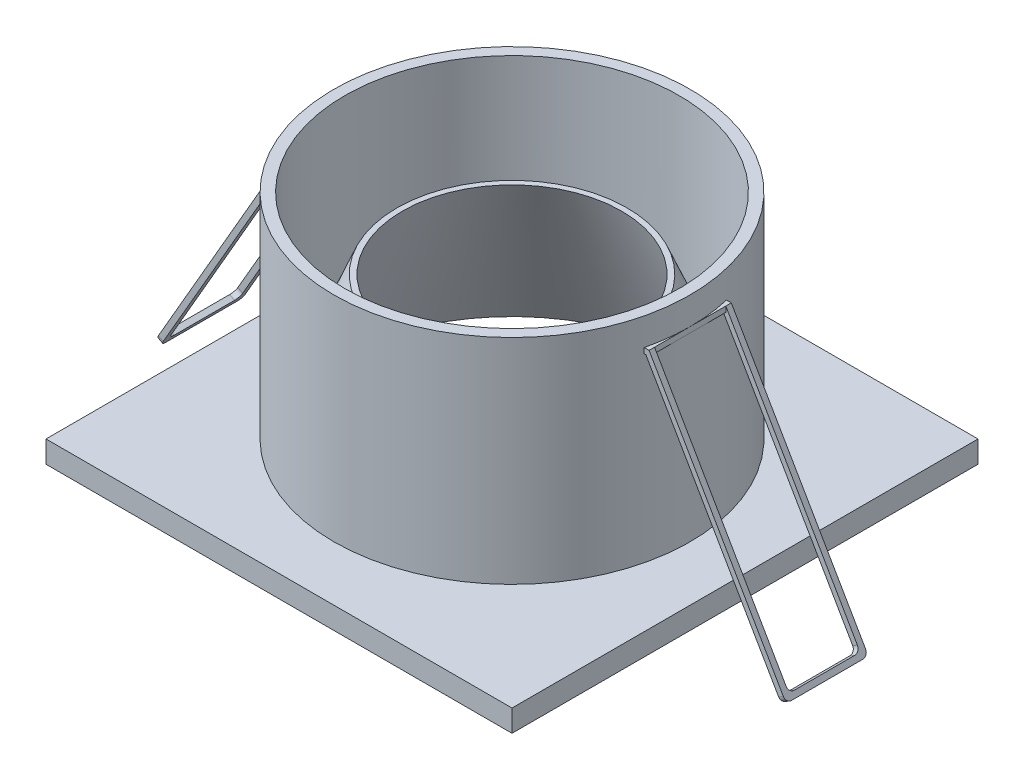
ISO-10303-21;
HEADER;
FILE_DESCRIPTION(('STEP AP214'),'2;1');
FILE_NAME('part.step','',(''),(''),'','','');
FILE_SCHEMA(('AUTOMOTIVE_DESIGN { 1 0 10303 214 1 1 1 1 }'));
ENDSEC;
DATA;
#1=APPLICATION_CONTEXT('core data for automotive mechanical design processes');
#2=APPLICATION_PROTOCOL_DEFINITION('international standard','automotive_design',2000,#1);
#3=PRODUCT_CONTEXT('',#1,'mechanical');
#4=PRODUCT('Part','Part','',(#3));
#5=PRODUCT_RELATED_PRODUCT_CATEGORY('part','',(#4));
#6=PRODUCT_DEFINITION_FORMATION('','',#4);
#7=PRODUCT_DEFINITION_CONTEXT('part definition',#1,'design');
#8=PRODUCT_DEFINITION('design','',#6,#7);
#9=PRODUCT_DEFINITION_SHAPE('','',#8);
#10=(LENGTH_UNIT() NAMED_UNIT(*) SI_UNIT(.MILLI.,.METRE.));
#11=(NAMED_UNIT(*) PLANE_ANGLE_UNIT() SI_UNIT($,.RADIAN.));
#12=(NAMED_UNIT(*) SI_UNIT($,.STERADIAN.) SOLID_ANGLE_UNIT());
#13=UNCERTAINTY_MEASURE_WITH_UNIT(LENGTH_MEASURE(1.E-05),#10,'distance_accuracy_value','');
#14=(GEOMETRIC_REPRESENTATION_CONTEXT(3) GLOBAL_UNCERTAINTY_ASSIGNED_CONTEXT((#13)) GLOBAL_UNIT_ASSIGNED_CONTEXT((#10,
#11,#12)) REPRESENTATION_CONTEXT('',''));
#15=CARTESIAN_POINT('',(0.,0.,0.));
#16=DIRECTION('',(0.,0.,1.));
#17=DIRECTION('',(1.,0.,0.));
#18=AXIS2_PLACEMENT_3D('',#15,#16,#17);
#19=CARTESIAN_POINT('',(100.002,37.,-35.));
#20=DIRECTION('',(0.,1.,0.));
#21=DIRECTION('',(0.,0.,1.));
#22=AXIS2_PLACEMENT_3D('',#19,#20,#21);
#23=PLANE('',#22);
#24=DIRECTION('',(-1.,0.,0.));
#25=VECTOR('',#24,1.);
#26=CARTESIAN_POINT('',(100.002,37.,-49.));
#27=LINE('',#26,#25);
#28=CARTESIAN_POINT('',(10.5773502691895,37.,-49.));
#29=VERTEX_POINT('',#28);
#30=CARTESIAN_POINT('',(9.99999999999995,37.,-49.));
#31=VERTEX_POINT('',#30);
#32=EDGE_CURVE('E399',#29,#31,#27,.T.);
#33=ORIENTED_EDGE('',*,*,#32,.F.);
#34=DIRECTION('',(0.,0.,1.));
#35=VECTOR('',#34,1.);
#36=CARTESIAN_POINT('',(10.5773502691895,37.,-35.));
#37=LINE('',#36,#35);
#38=CARTESIAN_POINT('',(10.5773502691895,37.,-50.));
#39=VERTEX_POINT('',#38);
#40=EDGE_CURVE('E376',#39,#29,#37,.T.);
#41=ORIENTED_EDGE('',*,*,#40,.F.);
#42=DIRECTION('',(-1.,0.,0.));
#43=VECTOR('',#42,1.);
#44=CARTESIAN_POINT('',(100.002,37.,-50.));
#45=LINE('',#44,#43);
#46=CARTESIAN_POINT('',(10.8772233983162,37.,-50.));
#47=VERTEX_POINT('',#46);
#48=EDGE_CURVE('E443',#47,#39,#45,.T.);
#49=ORIENTED_EDGE('',*,*,#48,.F.);
#50=CARTESIAN_POINT('',(42.5,37.,-42.5));
#51=DIRECTION('',(0.,1.,0.));
#52=DIRECTION('',(0.,0.,1.));
#53=AXIS2_PLACEMENT_3D('',#50,#51,#52);
#54=CIRCLE('',#53,32.5);
#55=CARTESIAN_POINT('',(9.99999999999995,37.,-42.5));
#56=VERTEX_POINT('',#55);
#57=EDGE_CURVE('E434',#56,#47,#54,.F.);
#58=ORIENTED_EDGE('',*,*,#57,.F.);
#59=DIRECTION('',(0.,0.,-1.));
#60=VECTOR('',#59,1.);
#61=CARTESIAN_POINT('',(9.99999999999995,37.,-35.));
#62=LINE('',#61,#60);
#63=EDGE_CURVE('E432',#56,#31,#62,.T.);
#64=ORIENTED_EDGE('',*,*,#63,.T.);
#65=EDGE_LOOP('',(#33,#41,#49,#58,#64));
#66=FACE_BOUND('',#65,.T.);
#67=ADVANCED_FACE('F47',(#66),#23,.F.);
#68=CARTESIAN_POINT('',(9.99999999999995,0.,0.));
#69=DIRECTION('',(-1.,0.,0.));
#70=DIRECTION('',(0.,0.,-1.));
#71=AXIS2_PLACEMENT_3D('',#68,#69,#70);
#72=PLANE('',#71);
#73=DIRECTION('',(0.,0.,1.));
#74=VECTOR('',#73,1.);
#75=CARTESIAN_POINT('',(9.99999999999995,38.,-50.));
#76=LINE('',#75,#74);
#77=CARTESIAN_POINT('',(9.99999999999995,38.,-49.));
#78=VERTEX_POINT('',#77);
#79=CARTESIAN_POINT('',(9.99999999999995,38.,-42.5));
#80=VERTEX_POINT('',#79);
#81=EDGE_CURVE('E433',#78,#80,#76,.T.);
#82=ORIENTED_EDGE('',*,*,#81,.F.);
#83=DIRECTION('',(0.,-1.,0.));
#84=VECTOR('',#83,1.);
#85=CARTESIAN_POINT('',(9.99999999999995,0.,-49.));
#86=LINE('',#85,#84);
#87=EDGE_CURVE('E12',#78,#31,#86,.T.);
#88=ORIENTED_EDGE('',*,*,#87,.T.);
#89=ORIENTED_EDGE('',*,*,#63,.F.);
#90=DIRECTION('',(0.,0.,-1.));
#91=VECTOR('',#90,1.);
#92=CARTESIAN_POINT('',(9.99999999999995,37.,-35.));
#93=LINE('',#92,#91);
#94=CARTESIAN_POINT('',(9.99999999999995,37.,-36.));
#95=VERTEX_POINT('',#94);
#96=EDGE_CURVE('E416',#95,#56,#93,.T.);
#97=ORIENTED_EDGE('',*,*,#96,.F.);
#98=DIRECTION('',(0.,-1.,0.));
#99=VECTOR('',#98,1.);
#100=CARTESIAN_POINT('',(9.99999999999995,0.,-36.));
#101=LINE('',#100,#99);
#102=CARTESIAN_POINT('',(9.99999999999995,38.,-36.));
#103=VERTEX_POINT('',#102);
#104=EDGE_CURVE('E71',#103,#95,#101,.T.);
#105=ORIENTED_EDGE('',*,*,#104,.F.);
#106=DIRECTION('',(0.,0.,1.));
#107=VECTOR('',#106,1.);
#108=CARTESIAN_POINT('',(9.99999999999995,38.,-50.));
#109=LINE('',#108,#107);
#110=EDGE_CURVE('E407',#80,#103,#109,.T.);
#111=ORIENTED_EDGE('',*,*,#110,.F.);
#112=EDGE_LOOP('',(#82,#88,#89,#97,#105,#111));
#113=FACE_BOUND('',#112,.T.);
#114=ADVANCED_FACE('F751',(#113),#72,.T.);
#115=CARTESIAN_POINT('',(42.5,43.,-42.5));
#116=DIRECTION('',(0.,-1.,0.));
#117=DIRECTION('',(0.,0.,-1.));
#118=AXIS2_PLACEMENT_3D('',#115,#116,#117);
#119=CYLINDRICAL_SURFACE('',#118,32.5);
#120=DIRECTION('',(0.,-1.,0.));
#121=VECTOR('',#120,1.);
#122=CARTESIAN_POINT('',(74.1227766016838,43.,-35.));
#123=LINE('',#122,#121);
#124=CARTESIAN_POINT('',(74.1227766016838,38.,-35.));
#125=VERTEX_POINT('',#124);
#126=CARTESIAN_POINT('',(74.1227766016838,37.,-35.));
#127=VERTEX_POINT('',#126);
#128=EDGE_CURVE('E569',#125,#127,#123,.T.);
#129=ORIENTED_EDGE('',*,*,#128,.F.);
#130=CARTESIAN_POINT('',(42.5,38.,-42.5));
#131=DIRECTION('',(0.,1.,0.));
#132=DIRECTION('',(0.,0.,1.));
#133=AXIS2_PLACEMENT_3D('',#130,#131,#132);
#134=CIRCLE('',#133,32.5);
#135=CARTESIAN_POINT('',(75.,38.,-42.5));
#136=VERTEX_POINT('',#135);
#137=EDGE_CURVE('E586',#136,#125,#134,.F.);
#138=ORIENTED_EDGE('',*,*,#137,.F.);
#139=CARTESIAN_POINT('',(42.5,38.,-42.5));
#140=DIRECTION('',(0.,1.,0.));
#141=DIRECTION('',(0.,0.,1.));
#142=AXIS2_PLACEMENT_3D('',#139,#140,#141);
#143=CIRCLE('',#142,32.5);
#144=CARTESIAN_POINT('',(74.1227766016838,38.,-50.));
#145=VERTEX_POINT('',#144);
#146=EDGE_CURVE('E601',#145,#136,#143,.F.);
#147=ORIENTED_EDGE('',*,*,#146,.F.);
#148=DIRECTION('',(0.,-1.,0.));
#149=VECTOR('',#148,1.);
#150=CARTESIAN_POINT('',(74.1227766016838,43.,-50.));
#151=LINE('',#150,#149);
#152=CARTESIAN_POINT('',(74.1227766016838,37.,-50.));
#153=VERTEX_POINT('',#152);
#154=EDGE_CURVE('E597',#153,#145,#151,.F.);
#155=ORIENTED_EDGE('',*,*,#154,.F.);
#156=CARTESIAN_POINT('',(42.5,37.,-42.5));
#157=DIRECTION('',(0.,-1.,0.));
#158=DIRECTION('',(0.,0.,-1.));
#159=AXIS2_PLACEMENT_3D('',#156,#157,#158);
#160=CIRCLE('',#159,32.5);
#161=CARTESIAN_POINT('',(75.,37.,-42.5));
#162=VERTEX_POINT('',#161);
#163=EDGE_CURVE('E582',#162,#153,#160,.F.);
#164=ORIENTED_EDGE('',*,*,#163,.F.);
#165=CARTESIAN_POINT('',(42.5,37.,-42.5));
#166=DIRECTION('',(0.,-1.,0.));
#167=DIRECTION('',(0.,0.,-1.));
#168=AXIS2_PLACEMENT_3D('',#165,#166,#167);
#169=CIRCLE('',#168,32.5);
#170=EDGE_CURVE('E578',#127,#162,#169,.F.);
#171=ORIENTED_EDGE('',*,*,#170,.F.);
#172=EDGE_LOOP('',(#129,#138,#147,#155,#164,#171));
#173=FACE_BOUND('',#172,.T.);
#174=CARTESIAN_POINT('',(42.5,43.,-42.5));
#175=DIRECTION('',(0.,1.,0.));
#176=DIRECTION('',(0.,0.,1.));
#177=AXIS2_PLACEMENT_3D('',#174,#175,#176);
#178=CIRCLE('',#177,32.5);
#179=CARTESIAN_POINT('',(42.5,43.,-9.99999999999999));
#180=VERTEX_POINT('',#179);
#181=EDGE_CURVE('E916',#180,#180,#178,.T.);
#182=ORIENTED_EDGE('',*,*,#181,.F.);
#183=EDGE_LOOP('',(#182));
#184=FACE_BOUND('',#183,.T.);
#185=CARTESIAN_POINT('',(42.5,4.,-42.5));
#186=DIRECTION('',(0.,1.,0.));
#187=DIRECTION('',(0.,0.,1.));
#188=AXIS2_PLACEMENT_3D('',#185,#186,#187);
#189=CIRCLE('',#188,32.5);
#190=CARTESIAN_POINT('',(42.5,4.,-9.99999999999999));
#191=VERTEX_POINT('',#190);
#192=EDGE_CURVE('E962',#191,#191,#189,.T.);
#193=ORIENTED_EDGE('',*,*,#192,.T.);
#194=EDGE_LOOP('',(#193));
#195=FACE_BOUND('',#194,.T.);
#196=CARTESIAN_POINT('',(42.5,38.,-42.5));
#197=DIRECTION('',(0.,-1.,0.));
#198=DIRECTION('',(0.,0.,-1.));
#199=AXIS2_PLACEMENT_3D('',#196,#197,#198);
#200=CIRCLE('',#199,32.5);
#201=CARTESIAN_POINT('',(10.8772233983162,38.,-35.));
#202=VERTEX_POINT('',#201);
#203=EDGE_CURVE('E408',#80,#202,#200,.F.);
#204=ORIENTED_EDGE('',*,*,#203,.T.);
#205=DIRECTION('',(0.,-1.,0.));
#206=VECTOR('',#205,1.);
#207=CARTESIAN_POINT('',(10.8772233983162,43.,-35.));
#208=LINE('',#207,#206);
#209=CARTESIAN_POINT('',(10.8772233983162,37.,-35.));
#210=VERTEX_POINT('',#209);
#211=EDGE_CURVE('E403',#202,#210,#208,.T.);
#212=ORIENTED_EDGE('',*,*,#211,.T.);
#213=CARTESIAN_POINT('',(42.5,37.,-42.5));
#214=DIRECTION('',(0.,1.,0.));
#215=DIRECTION('',(0.,0.,1.));
#216=AXIS2_PLACEMENT_3D('',#213,#214,#215);
#217=CIRCLE('',#216,32.5);
#218=EDGE_CURVE('E402',#210,#56,#217,.F.);
#219=ORIENTED_EDGE('',*,*,#218,.T.);
#220=ORIENTED_EDGE('',*,*,#57,.T.);
#221=DIRECTION('',(0.,-1.,0.));
#222=VECTOR('',#221,1.);
#223=CARTESIAN_POINT('',(10.8772233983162,43.,-50.));
#224=LINE('',#223,#222);
#225=CARTESIAN_POINT('',(10.8772233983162,38.,-50.));
#226=VERTEX_POINT('',#225);
#227=EDGE_CURVE('E419',#47,#226,#224,.F.);
#228=ORIENTED_EDGE('',*,*,#227,.T.);
#229=CARTESIAN_POINT('',(42.5,38.,-42.5));
#230=DIRECTION('',(0.,-1.,0.));
#231=DIRECTION('',(0.,0.,-1.));
#232=AXIS2_PLACEMENT_3D('',#229,#230,#231);
#233=CIRCLE('',#232,32.5);
#234=EDGE_CURVE('E439',#226,#80,#233,.F.);
#235=ORIENTED_EDGE('',*,*,#234,.T.);
#236=EDGE_LOOP('',(#204,#212,#219,#220,#228,#235));
#237=FACE_BOUND('',#236,.T.);
#238=ADVANCED_FACE('F758',(#173,#184,#195,#237),#119,.T.);
#239=CARTESIAN_POINT('',(75.,0.,0.));
#240=DIRECTION('',(1.,0.,0.));
#241=DIRECTION('',(0.,0.,-1.));
#242=AXIS2_PLACEMENT_3D('',#239,#240,#241);
#243=PLANE('',#242);
#244=DIRECTION('',(0.,0.,1.));
#245=VECTOR('',#244,1.);
#246=CARTESIAN_POINT('',(75.,38.,-50.));
#247=LINE('',#246,#245);
#248=CARTESIAN_POINT('',(75.,38.,-36.));
#249=VERTEX_POINT('',#248);
#250=EDGE_CURVE('E577',#136,#249,#247,.T.);
#251=ORIENTED_EDGE('',*,*,#250,.T.);
#252=DIRECTION('',(0.,-1.,0.));
#253=VECTOR('',#252,1.);
#254=CARTESIAN_POINT('',(75.,0.,-36.));
#255=LINE('',#254,#253);
#256=CARTESIAN_POINT('',(75.,37.,-36.));
#257=VERTEX_POINT('',#256);
#258=EDGE_CURVE('E561',#249,#257,#255,.T.);
#259=ORIENTED_EDGE('',*,*,#258,.T.);
#260=DIRECTION('',(0.,0.,-1.));
#261=VECTOR('',#260,1.);
#262=CARTESIAN_POINT('',(75.,37.,-35.));
#263=LINE('',#262,#261);
#264=EDGE_CURVE('E574',#257,#162,#263,.T.);
#265=ORIENTED_EDGE('',*,*,#264,.T.);
#266=DIRECTION('',(0.,0.,-1.));
#267=VECTOR('',#266,1.);
#268=CARTESIAN_POINT('',(75.,37.,-35.));
#269=LINE('',#268,#267);
#270=CARTESIAN_POINT('',(75.,37.,-49.));
#271=VERTEX_POINT('',#270);
#272=EDGE_CURVE('E606',#162,#271,#269,.T.);
#273=ORIENTED_EDGE('',*,*,#272,.T.);
#274=DIRECTION('',(0.,-1.,0.));
#275=VECTOR('',#274,1.);
#276=CARTESIAN_POINT('',(75.,0.,-49.));
#277=LINE('',#276,#275);
#278=CARTESIAN_POINT('',(75.,38.,-49.));
#279=VERTEX_POINT('',#278);
#280=EDGE_CURVE('E847',#279,#271,#277,.T.);
#281=ORIENTED_EDGE('',*,*,#280,.F.);
#282=DIRECTION('',(0.,0.,1.));
#283=VECTOR('',#282,1.);
#284=CARTESIAN_POINT('',(75.,38.,-50.));
#285=LINE('',#284,#283);
#286=EDGE_CURVE('E607',#279,#136,#285,.T.);
#287=ORIENTED_EDGE('',*,*,#286,.T.);
#288=EDGE_LOOP('',(#251,#259,#265,#273,#281,#287));
#289=FACE_BOUND('',#288,.T.);
#290=ADVANCED_FACE('F816',(#289),#243,.T.);
#291=CARTESIAN_POINT('',(-0.002000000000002,37.,-35.));
#292=DIRECTION('',(0.,-1.,0.));
#293=DIRECTION('',(0.,0.,-1.));
#294=AXIS2_PLACEMENT_3D('',#291,#292,#293);
#295=PLANE('',#294);
#296=ORIENTED_EDGE('',*,*,#264,.F.);
#297=DIRECTION('',(-1.,0.,0.));
#298=VECTOR('',#297,1.);
#299=CARTESIAN_POINT('',(-0.002000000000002,37.,-36.));
#300=LINE('',#299,#298);
#301=CARTESIAN_POINT('',(74.4226497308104,37.,-36.));
#302=VERTEX_POINT('',#301);
#303=EDGE_CURVE('E850',#257,#302,#300,.T.);
#304=ORIENTED_EDGE('',*,*,#303,.T.);
#305=DIRECTION('',(0.,0.,1.));
#306=VECTOR('',#305,1.);
#307=CARTESIAN_POINT('',(74.4226497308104,37.,-35.));
#308=LINE('',#307,#306);
#309=CARTESIAN_POINT('',(74.4226497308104,37.,-35.));
#310=VERTEX_POINT('',#309);
#311=EDGE_CURVE('E720',#302,#310,#308,.T.);
#312=ORIENTED_EDGE('',*,*,#311,.T.);
#313=DIRECTION('',(1.,0.,0.));
#314=VECTOR('',#313,1.);
#315=CARTESIAN_POINT('',(-0.002000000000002,37.,-35.));
#316=LINE('',#315,#314);
#317=EDGE_CURVE('E573',#127,#310,#316,.T.);
#318=ORIENTED_EDGE('',*,*,#317,.F.);
#319=ORIENTED_EDGE('',*,*,#170,.T.);
#320=EDGE_LOOP('',(#296,#304,#312,#318,#319));
#321=FACE_BOUND('',#320,.T.);
#322=ADVANCED_FACE('F748',(#321),#295,.T.);
#323=CARTESIAN_POINT('',(0.,4.,0.));
#324=DIRECTION('',(1.,0.,0.));
#325=DIRECTION('',(0.,0.,-1.));
#326=AXIS2_PLACEMENT_3D('',#323,#324,#325);
#327=PLANE('',#326);
#328=DIRECTION('',(0.,0.,1.));
#329=VECTOR('',#328,1.);
#330=CARTESIAN_POINT('',(0.,0.,0.));
#331=LINE('',#330,#329);
#332=CARTESIAN_POINT('',(0.,0.,-85.));
#333=VERTEX_POINT('',#332);
#334=CARTESIAN_POINT('',(0.,0.,0.));
#335=VERTEX_POINT('',#334);
#336=EDGE_CURVE('E920',#333,#335,#331,.T.);
#337=ORIENTED_EDGE('',*,*,#336,.T.);
#338=DIRECTION('',(0.,-1.,0.));
#339=VECTOR('',#338,1.);
#340=CARTESIAN_POINT('',(0.,4.,0.));
#341=LINE('',#340,#339);
#342=CARTESIAN_POINT('',(0.,4.,0.));
#343=VERTEX_POINT('',#342);
#344=EDGE_CURVE('E958',#343,#335,#341,.T.);
#345=ORIENTED_EDGE('',*,*,#344,.F.);
#346=DIRECTION('',(0.,0.,1.));
#347=VECTOR('',#346,1.);
#348=CARTESIAN_POINT('',(0.,4.,0.));
#349=LINE('',#348,#347);
#350=CARTESIAN_POINT('',(0.,4.,-85.));
#351=VERTEX_POINT('',#350);
#352=EDGE_CURVE('E933',#351,#343,#349,.T.);
#353=ORIENTED_EDGE('',*,*,#352,.F.);
#354=DIRECTION('',(0.,-1.,0.));
#355=VECTOR('',#354,1.);
#356=CARTESIAN_POINT('',(0.,4.,-85.));
#357=LINE('',#356,#355);
#358=EDGE_CURVE('E946',#351,#333,#357,.T.);
#359=ORIENTED_EDGE('',*,*,#358,.T.);
#360=EDGE_LOOP('',(#337,#345,#353,#359));
#361=FACE_BOUND('',#360,.T.);
#362=ADVANCED_FACE('F49',(#361),#327,.F.);
#363=CARTESIAN_POINT('',(0.,4.,0.));
#364=DIRECTION('',(0.,0.,-1.));
#365=DIRECTION('',(-1.,0.,0.));
#366=AXIS2_PLACEMENT_3D('',#363,#364,#365);
#367=PLANE('',#366);
#368=DIRECTION('',(1.,0.,0.));
#369=VECTOR('',#368,1.);
#370=CARTESIAN_POINT('',(0.,0.,0.));
#371=LINE('',#370,#369);
#372=CARTESIAN_POINT('',(85.,0.,0.));
#373=VERTEX_POINT('',#372);
#374=EDGE_CURVE('E924',#335,#373,#371,.T.);
#375=ORIENTED_EDGE('',*,*,#374,.T.);
#376=DIRECTION('',(0.,-1.,0.));
#377=VECTOR('',#376,1.);
#378=CARTESIAN_POINT('',(85.,4.,0.));
#379=LINE('',#378,#377);
#380=CARTESIAN_POINT('',(85.,4.,0.));
#381=VERTEX_POINT('',#380);
#382=EDGE_CURVE('E954',#381,#373,#379,.T.);
#383=ORIENTED_EDGE('',*,*,#382,.F.);
#384=DIRECTION('',(1.,0.,0.));
#385=VECTOR('',#384,1.);
#386=CARTESIAN_POINT('',(0.,4.,0.));
#387=LINE('',#386,#385);
#388=EDGE_CURVE('E937',#343,#381,#387,.T.);
#389=ORIENTED_EDGE('',*,*,#388,.F.);
#390=ORIENTED_EDGE('',*,*,#344,.T.);
#391=EDGE_LOOP('',(#375,#383,#389,#390));
#392=FACE_BOUND('',#391,.T.);
#393=ADVANCED_FACE('F741',(#392),#367,.F.);
#394=CARTESIAN_POINT('',(85.,4.,0.));
#395=DIRECTION('',(-1.,0.,0.));
#396=DIRECTION('',(0.,0.,1.));
#397=AXIS2_PLACEMENT_3D('',#394,#395,#396);
#398=PLANE('',#397);
#399=DIRECTION('',(0.,0.,-1.));
#400=VECTOR('',#399,1.);
#401=CARTESIAN_POINT('',(85.,0.,0.));
#402=LINE('',#401,#400);
#403=CARTESIAN_POINT('',(85.,0.,-85.));
#404=VERTEX_POINT('',#403);
#405=EDGE_CURVE('E927',#373,#404,#402,.T.);
#406=ORIENTED_EDGE('',*,*,#405,.T.);
#407=DIRECTION('',(0.,-1.,0.));
#408=VECTOR('',#407,1.);
#409=CARTESIAN_POINT('',(85.,4.,-85.));
#410=LINE('',#409,#408);
#411=CARTESIAN_POINT('',(85.,4.,-85.));
#412=VERTEX_POINT('',#411);
#413=EDGE_CURVE('E950',#412,#404,#410,.T.);
#414=ORIENTED_EDGE('',*,*,#413,.F.);
#415=DIRECTION('',(0.,0.,-1.));
#416=VECTOR('',#415,1.);
#417=CARTESIAN_POINT('',(85.,4.,0.));
#418=LINE('',#417,#416);
#419=EDGE_CURVE('E940',#381,#412,#418,.T.);
#420=ORIENTED_EDGE('',*,*,#419,.F.);
#421=ORIENTED_EDGE('',*,*,#382,.T.);
#422=EDGE_LOOP('',(#406,#414,#420,#421));
#423=FACE_BOUND('',#422,.T.);
#424=ADVANCED_FACE('F738',(#423),#398,.F.);
#425=CARTESIAN_POINT('',(0.,4.,-85.));
#426=DIRECTION('',(0.,0.,1.));
#427=DIRECTION('',(1.,0.,0.));
#428=AXIS2_PLACEMENT_3D('',#425,#426,#427);
#429=PLANE('',#428);
#430=DIRECTION('',(-1.,0.,0.));
#431=VECTOR('',#430,1.);
#432=CARTESIAN_POINT('',(0.,0.,-85.));
#433=LINE('',#432,#431);
#434=EDGE_CURVE('E930',#404,#333,#433,.T.);
#435=ORIENTED_EDGE('',*,*,#434,.T.);
#436=ORIENTED_EDGE('',*,*,#358,.F.);
#437=DIRECTION('',(-1.,0.,0.));
#438=VECTOR('',#437,1.);
#439=CARTESIAN_POINT('',(0.,4.,-85.));
#440=LINE('',#439,#438);
#441=EDGE_CURVE('E943',#412,#351,#440,.T.);
#442=ORIENTED_EDGE('',*,*,#441,.F.);
#443=ORIENTED_EDGE('',*,*,#413,.T.);
#444=EDGE_LOOP('',(#435,#436,#442,#443));
#445=FACE_BOUND('',#444,.T.);
#446=ADVANCED_FACE('F735',(#445),#429,.F.);
#447=CARTESIAN_POINT('',(0.,4.,0.));
#448=DIRECTION('',(0.,-1.,0.));
#449=DIRECTION('',(0.,0.,-1.));
#450=AXIS2_PLACEMENT_3D('',#447,#448,#449);
#451=PLANE('',#450);
#452=ORIENTED_EDGE('',*,*,#192,.F.);
#453=EDGE_LOOP('',(#452));
#454=FACE_BOUND('',#453,.T.);
#455=ORIENTED_EDGE('',*,*,#352,.T.);
#456=ORIENTED_EDGE('',*,*,#388,.T.);
#457=ORIENTED_EDGE('',*,*,#419,.T.);
#458=ORIENTED_EDGE('',*,*,#441,.T.);
#459=EDGE_LOOP('',(#455,#456,#457,#458));
#460=FACE_BOUND('',#459,.T.);
#461=ADVANCED_FACE('F733',(#454,#460),#451,.F.);
#462=CARTESIAN_POINT('',(0.,0.,0.));
#463=DIRECTION('',(0.,-1.,0.));
#464=DIRECTION('',(0.,0.,-1.));
#465=AXIS2_PLACEMENT_3D('',#462,#463,#464);
#466=PLANE('',#465);
#467=CARTESIAN_POINT('',(42.5,0.,-42.5));
#468=DIRECTION('',(0.,-1.,0.));
#469=DIRECTION('',(0.,0.,-1.));
#470=AXIS2_PLACEMENT_3D('',#467,#468,#469);
#471=CIRCLE('',#470,33.);
#472=CARTESIAN_POINT('',(42.5,0.,-75.5));
#473=VERTEX_POINT('',#472);
#474=EDGE_CURVE('E611',#473,#473,#471,.T.);
#475=ORIENTED_EDGE('',*,*,#474,.F.);
#476=EDGE_LOOP('',(#475));
#477=FACE_BOUND('',#476,.T.);
#478=ORIENTED_EDGE('',*,*,#336,.F.);
#479=ORIENTED_EDGE('',*,*,#434,.F.);
#480=ORIENTED_EDGE('',*,*,#405,.F.);
#481=ORIENTED_EDGE('',*,*,#374,.F.);
#482=EDGE_LOOP('',(#478,#479,#480,#481));
#483=FACE_BOUND('',#482,.T.);
#484=ADVANCED_FACE('F722',(#477,#483),#466,.T.);
#485=CARTESIAN_POINT('',(42.5,43.,-42.5));
#486=DIRECTION('',(0.,1.,0.));
#487=DIRECTION('',(0.,0.,1.));
#488=AXIS2_PLACEMENT_3D('',#485,#486,#487);
#489=PLANE('',#488);
#490=CARTESIAN_POINT('',(42.5,43.,-42.5));
#491=DIRECTION('',(0.,1.,0.));
#492=DIRECTION('',(0.,0.,1.));
#493=AXIS2_PLACEMENT_3D('',#490,#491,#492);
#494=CIRCLE('',#493,30.5);
#495=CARTESIAN_POINT('',(42.5,43.,-12.));
#496=VERTEX_POINT('',#495);
#497=EDGE_CURVE('E913',#496,#496,#494,.T.);
#498=ORIENTED_EDGE('',*,*,#497,.F.);
#499=EDGE_LOOP('',(#498));
#500=FACE_BOUND('',#499,.T.);
#501=ORIENTED_EDGE('',*,*,#181,.T.);
#502=EDGE_LOOP('',(#501));
#503=FACE_BOUND('',#502,.T.);
#504=ADVANCED_FACE('F732',(#500,#503),#489,.T.);
#505=CARTESIAN_POINT('',(42.5,4.,-42.5));
#506=DIRECTION('',(0.,1.,0.));
#507=DIRECTION('',(0.,0.,1.));
#508=AXIS2_PLACEMENT_3D('',#505,#506,#507);
#509=CYLINDRICAL_SURFACE('',#508,30.5);
#510=CARTESIAN_POINT('',(42.5,7.83066325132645,-42.5));
#511=DIRECTION('',(0.,1.,0.));
#512=DIRECTION('',(0.,0.,1.));
#513=AXIS2_PLACEMENT_3D('',#510,#511,#512);
#514=CIRCLE('',#513,30.5);
#515=CARTESIAN_POINT('',(50.6426238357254,7.83066325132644,-71.8929868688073));
#516=VERTEX_POINT('',#515);
#517=EDGE_CURVE('E910',#516,#516,#514,.F.);
#518=ORIENTED_EDGE('',*,*,#517,.T.);
#519=EDGE_LOOP('',(#518));
#520=FACE_BOUND('',#519,.T.);
#521=ORIENTED_EDGE('',*,*,#497,.T.);
#522=EDGE_LOOP('',(#521));
#523=FACE_BOUND('',#522,.T.);
#524=ADVANCED_FACE('F699',(#520,#523),#509,.F.);
#525=CARTESIAN_POINT('',(52.8439076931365,0.,-74.888324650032));
#526=CARTESIAN_POINT('',(44.4105842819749,30.,-63.4129067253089));
#527=CARTESIAN_POINT('',(-11.9327416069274,0.,-95.576140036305));
#528=CARTESIAN_POINT('',(2.58477083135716,30.,-67.2340752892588));
#529=CARTESIAN_POINT('',(-32.6205569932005,0.,-30.7994907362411));
#530=CARTESIAN_POINT('',(-1.23639773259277,30.,-25.408261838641));
#531=CARTESIAN_POINT('',(32.1560923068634,0.,-10.111675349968));
#532=CARTESIAN_POINT('',(40.589415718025,30.,-21.5870932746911));
#533=CARTESIAN_POINT('',(96.9327416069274,0.,10.576140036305));
#534=CARTESIAN_POINT('',(82.4152291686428,30.,-17.7659247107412));
#535=CARTESIAN_POINT('',(117.6205569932,0.,-54.2005092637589));
#536=CARTESIAN_POINT('',(86.2363977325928,30.,-59.591738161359));
#537=CARTESIAN_POINT('',(52.8439076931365,0.,-74.888324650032));
#538=CARTESIAN_POINT('',(44.4105842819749,30.,-63.4129067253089));
#539=(BOUNDED_SURFACE() B_SPLINE_SURFACE(3,1,((#525,#526),(#527,#528),(#529,#530),(#531,#532),
(#533,#534),(#535,#536),(#537,#538)),.UNSPECIFIED.,.T.,.F.,.F.) B_SPLINE_SURFACE_WITH_KNOTS((4,
3,4),(2,2),(0.,0.5,1.),(0.,1.),
.UNSPECIFIED.) GEOMETRIC_REPRESENTATION_ITEM() RATIONAL_B_SPLINE_SURFACE(((1.,1.),
(0.333333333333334,0.333333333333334),(0.333333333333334,0.333333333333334),(1.,1.),
(0.333333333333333,0.333333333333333),(0.333333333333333,0.333333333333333),(1.,1.))) REPRESENTATION_ITEM('') SURFACE());
#540=CARTESIAN_POINT('',(42.5,30.,-42.5));
#541=DIRECTION('',(0.,-1.,0.));
#542=DIRECTION('',(0.,0.,-1.));
#543=AXIS2_PLACEMENT_3D('',#540,#541,#542);
#544=CIRCLE('',#543,21.);
#545=CARTESIAN_POINT('',(44.4105842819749,30.,-63.4129067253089));
#546=VERTEX_POINT('',#545);
#547=EDGE_CURVE('E669',#546,#546,#544,.T.);
#548=CARTESIAN_POINT('',(44.4105842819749,30.,-63.4129067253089));
#549=CARTESIAN_POINT('',(44.4755013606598,29.769069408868,-63.5012408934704));
#550=CARTESIAN_POINT('',(44.5404184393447,29.538138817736,-63.5895750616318));
#551=CARTESIAN_POINT('',(44.6702525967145,29.0762776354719,-63.7662433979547));
#552=CARTESIAN_POINT('',(44.7351696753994,28.8453470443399,-63.8545775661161));
#553=CARTESIAN_POINT('',(44.8650038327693,28.3834858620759,-64.031245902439));
#554=CARTESIAN_POINT('',(44.9299209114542,28.1525552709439,-64.1195800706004));
#555=CARTESIAN_POINT('',(45.0597550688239,27.6906940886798,-64.2962484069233));
#556=CARTESIAN_POINT('',(45.1246721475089,27.4597634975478,-64.3845825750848));
#557=CARTESIAN_POINT('',(45.2545063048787,26.9979023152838,-64.5612509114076));
#558=CARTESIAN_POINT('',(45.3194233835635,26.7669717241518,-64.6495850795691));
#559=CARTESIAN_POINT('',(45.4492575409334,26.3051105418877,-64.826253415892));
#560=CARTESIAN_POINT('',(45.5141746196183,26.0741799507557,-64.9145875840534));
#561=CARTESIAN_POINT('',(45.6440087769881,25.6123187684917,-65.0912559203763));
#562=CARTESIAN_POINT('',(45.708925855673,25.3813881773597,-65.1795900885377));
#563=CARTESIAN_POINT('',(45.8387600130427,24.9195269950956,-65.3562584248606));
#564=CARTESIAN_POINT('',(45.9036770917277,24.6885964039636,-65.4445925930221));
#565=CARTESIAN_POINT('',(46.0335112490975,24.2267352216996,-65.6212609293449));
#566=CARTESIAN_POINT('',(46.0984283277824,23.9958046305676,-65.7095950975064));
#567=CARTESIAN_POINT('',(46.2282624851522,23.5339434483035,-65.8862634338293));
#568=CARTESIAN_POINT('',(46.2931795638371,23.3030128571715,-65.9745976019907));
#569=CARTESIAN_POINT('',(46.4230137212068,22.8411516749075,-66.1512659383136));
#570=CARTESIAN_POINT('',(46.4879307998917,22.6102210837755,-66.239600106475));
#571=CARTESIAN_POINT('',(46.6177649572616,22.1483599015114,-66.4162684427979));
#572=CARTESIAN_POINT('',(46.6826820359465,21.9174293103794,-66.5046026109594));
#573=CARTESIAN_POINT('',(46.8125161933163,21.4555681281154,-66.6812709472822));
#574=CARTESIAN_POINT('',(46.8774332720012,21.2246375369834,-66.7696051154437));
#575=CARTESIAN_POINT('',(47.007267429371,20.7627763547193,-66.9462734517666));
#576=CARTESIAN_POINT('',(47.0721845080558,20.5318457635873,-67.034607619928));
#577=CARTESIAN_POINT('',(47.2020186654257,20.0699845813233,-67.2112759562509));
#578=CARTESIAN_POINT('',(47.2669357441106,19.8390539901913,-67.2996101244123));
#579=CARTESIAN_POINT('',(47.3967699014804,19.3771928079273,-67.4762784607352));
#580=CARTESIAN_POINT('',(47.4616869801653,19.1462622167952,-67.5646126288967));
#581=CARTESIAN_POINT('',(47.5915211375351,18.6844010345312,-67.7412809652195));
#582=CARTESIAN_POINT('',(47.65643821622,18.4534704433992,-67.829615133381));
#583=CARTESIAN_POINT('',(47.7862723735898,17.9916092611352,-68.0062834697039));
#584=CARTESIAN_POINT('',(47.8511894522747,17.7606786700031,-68.0946176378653));
#585=CARTESIAN_POINT('',(47.9810236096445,17.2988174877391,-68.2712859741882));
#586=CARTESIAN_POINT('',(48.0459406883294,17.0678868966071,-68.3596201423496));
#587=CARTESIAN_POINT('',(48.1757748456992,16.6060257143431,-68.5362884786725));
#588=CARTESIAN_POINT('',(48.2406919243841,16.375095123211,-68.624622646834));
#589=CARTESIAN_POINT('',(48.3705260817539,15.913233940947,-68.8012909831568));
#590=CARTESIAN_POINT('',(48.4354431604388,15.682303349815,-68.8896251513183));
#591=CARTESIAN_POINT('',(48.5652773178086,15.220442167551,-69.0662934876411));
#592=CARTESIAN_POINT('',(48.6301943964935,14.9895115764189,-69.1546276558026));
#593=CARTESIAN_POINT('',(48.7600285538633,14.5276503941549,-69.3312959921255));
#594=CARTESIAN_POINT('',(48.8249456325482,14.2967198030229,-69.4196301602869));
#595=CARTESIAN_POINT('',(48.954779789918,13.8348586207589,-69.5962984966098));
#596=CARTESIAN_POINT('',(49.0196968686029,13.6039280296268,-69.6846326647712));
#597=CARTESIAN_POINT('',(49.1495310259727,13.1420668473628,-69.8613010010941));
#598=CARTESIAN_POINT('',(49.2144481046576,12.9111362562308,-69.9496351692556));
#599=CARTESIAN_POINT('',(49.3442822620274,12.4492750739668,-70.1263035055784));
#600=CARTESIAN_POINT('',(49.4091993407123,12.2183444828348,-70.2146376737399));
#601=CARTESIAN_POINT('',(49.5390334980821,11.7564833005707,-70.3913060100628));
#602=CARTESIAN_POINT('',(49.603950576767,11.5255527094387,-70.4796401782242));
#603=CARTESIAN_POINT('',(49.7337847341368,11.0636915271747,-70.6563085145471));
#604=CARTESIAN_POINT('',(49.7987018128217,10.8327609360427,-70.7446426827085));
#605=CARTESIAN_POINT('',(49.9285359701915,10.3708997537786,-70.9213110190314));
#606=CARTESIAN_POINT('',(49.9934530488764,10.1399691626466,-71.0096451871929));
#607=CARTESIAN_POINT('',(50.1232872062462,9.67810798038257,-71.1863135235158));
#608=CARTESIAN_POINT('',(50.1882042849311,9.44717738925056,-71.2746476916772));
#609=CARTESIAN_POINT('',(50.3180384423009,8.98531620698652,-71.4513160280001));
#610=CARTESIAN_POINT('',(50.3829555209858,8.75438561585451,-71.5396501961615));
#611=CARTESIAN_POINT('',(50.5127896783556,8.29252443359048,-71.7163185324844));
#612=CARTESIAN_POINT('',(50.5777067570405,8.06159384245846,-71.8046527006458));
#613=CARTESIAN_POINT('',(50.6426238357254,7.83066325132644,-71.8929868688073));
#614=B_SPLINE_CURVE_WITH_KNOTS('',3,(#548,#549,#550,#551,#552,#553,#554,#555,#556,#557,#558,
#559,#560,#561,#562,#563,#564,#565,#566,#567,#568,#569,#570,#571,#572,#573,#574,#575,#576,#577,
#578,#579,#580,#581,#582,#583,#584,#585,#586,#587,#588,#589,#590,#591,#592,#593,#594,#595,#596,
#597,#598,#599,#600,#601,#602,#603,#604,#605,#606,#607,#608,#609,#610,#611,#612,#613),
.UNSPECIFIED.,.F.,.F.,(4,2,2,2,2,2,2,2,2,2,2,2,2,2,2,2,2,2,2,2,2,2,2,2,2,2,2,2,2,2,2,2,4),(0.,
0.766886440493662,1.53377288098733,2.30065932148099,3.06754576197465,3.83443220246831,
4.60131864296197,5.36820508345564,6.1350915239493,6.90197796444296,7.66886440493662,
8.43575084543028,9.20263728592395,9.96952372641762,10.7364101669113,11.5032966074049,
12.2701830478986,13.0370694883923,13.8039559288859,14.5708423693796,15.3377288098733,
16.1046152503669,16.8715016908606,17.6383881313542,18.4052745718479,19.1721610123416,
19.9390474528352,20.7059338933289,21.4728203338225,22.2397067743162,23.0065932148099,
23.7734796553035,24.5403660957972),.UNSPECIFIED.);
#615=EDGE_CURVE('BSEAM648',#546,#516,#614,.T.);
#616=ORIENTED_EDGE('',*,*,#547,.T.);
#617=ORIENTED_EDGE('',*,*,#517,.F.);
#618=ORIENTED_EDGE('',*,*,#615,.T.);
#619=ORIENTED_EDGE('',*,*,#615,.F.);
#620=EDGE_LOOP('',(#616,#618,#617,#619));
#621=FACE_BOUND('',#620,.T.);
#622=ADVANCED_FACE('F648',(#621),#539,.T.);
#623=CARTESIAN_POINT('',(42.5,30.,-42.5));
#624=DIRECTION('',(0.,-1.,0.));
#625=DIRECTION('',(0.,0.,-1.));
#626=AXIS2_PLACEMENT_3D('',#623,#624,#625);
#627=PLANE('',#626);
#628=CARTESIAN_POINT('',(42.5,30.,-42.5));
#629=DIRECTION('',(0.,1.,0.));
#630=DIRECTION('',(0.,0.,1.));
#631=AXIS2_PLACEMENT_3D('',#628,#629,#630);
#632=CIRCLE('',#631,20.);
#633=CARTESIAN_POINT('',(42.5,30.,-22.5));
#634=VERTEX_POINT('',#633);
#635=EDGE_CURVE('E664',#634,#634,#632,.T.);
#636=ORIENTED_EDGE('',*,*,#635,.F.);
#637=EDGE_LOOP('',(#636));
#638=FACE_BOUND('',#637,.T.);
#639=ORIENTED_EDGE('',*,*,#547,.F.);
#640=EDGE_LOOP('',(#639));
#641=FACE_BOUND('',#640,.T.);
#642=ADVANCED_FACE('F645',(#638,#641),#627,.F.);
#643=CARTESIAN_POINT('',(42.5,30.,-42.5));
#644=DIRECTION('',(0.,-1.,0.));
#645=DIRECTION('',(0.,0.,-1.));
#646=AXIS2_PLACEMENT_3D('',#643,#644,#645);
#647=CONICAL_SURFACE('',#646,20.,0.408907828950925);
#648=ORIENTED_EDGE('',*,*,#474,.T.);
#649=EDGE_LOOP('',(#648));
#650=FACE_BOUND('',#649,.T.);
#651=ORIENTED_EDGE('',*,*,#635,.T.);
#652=EDGE_LOOP('',(#651));
#653=FACE_BOUND('',#652,.T.);
#654=ADVANCED_FACE('F634',(#650,#653),#647,.F.);
#655=CARTESIAN_POINT('',(-0.002000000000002,38.,-50.));
#656=DIRECTION('',(0.,1.,0.));
#657=DIRECTION('',(0.,0.,1.));
#658=AXIS2_PLACEMENT_3D('',#655,#656,#657);
#659=PLANE('',#658);
#660=DIRECTION('',(1.,0.,0.));
#661=VECTOR('',#660,1.);
#662=CARTESIAN_POINT('',(-0.002000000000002,38.,-50.));
#663=LINE('',#662,#661);
#664=CARTESIAN_POINT('',(75.,38.,-50.));
#665=VERTEX_POINT('',#664);
#666=EDGE_CURVE('E612',#145,#665,#663,.T.);
#667=ORIENTED_EDGE('',*,*,#666,.F.);
#668=ORIENTED_EDGE('',*,*,#146,.T.);
#669=ORIENTED_EDGE('',*,*,#286,.F.);
#670=EDGE_CURVE('E602',#665,#279,#285,.T.);
#671=ORIENTED_EDGE('',*,*,#670,.F.);
#672=EDGE_LOOP('',(#667,#668,#669,#671));
#673=FACE_BOUND('',#672,.T.);
#674=ADVANCED_FACE('F644',(#673),#659,.T.);
#675=CARTESIAN_POINT('',(-0.002000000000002,37.,-50.));
#676=DIRECTION('',(0.,0.,-1.));
#677=DIRECTION('',(-1.,0.,0.));
#678=AXIS2_PLACEMENT_3D('',#675,#676,#677);
#679=PLANE('',#678);
#680=ORIENTED_EDGE('',*,*,#666,.T.);
#681=DIRECTION('',(0.500000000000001,-0.866025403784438,0.));
#682=VECTOR('',#681,1.);
#683=CARTESIAN_POINT('',(72.7044826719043,41.9759526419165,-50.));
#684=LINE('',#683,#682);
#685=CARTESIAN_POINT('',(99.5,-4.43524478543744,-50.));
#686=VERTEX_POINT('',#685);
#687=EDGE_CURVE('E496',#665,#686,#684,.T.);
#688=ORIENTED_EDGE('',*,*,#687,.T.);
#689=DIRECTION('',(0.866025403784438,0.500000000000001,0.));
#690=VECTOR('',#689,1.);
#691=CARTESIAN_POINT('',(98.6339745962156,-4.93524478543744,-50.));
#692=LINE('',#691,#690);
#693=CARTESIAN_POINT('',(98.6339745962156,-4.93524478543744,-50.));
#694=VERTEX_POINT('',#693);
#695=EDGE_CURVE('E492',#694,#686,#692,.T.);
#696=ORIENTED_EDGE('',*,*,#695,.F.);
#697=DIRECTION('',(0.500000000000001,-0.866025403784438,0.));
#698=VECTOR('',#697,1.);
#699=CARTESIAN_POINT('',(71.8384572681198,41.4759526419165,-50.));
#700=LINE('',#699,#698);
#701=CARTESIAN_POINT('',(74.4226497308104,37.,-50.));
#702=VERTEX_POINT('',#701);
#703=EDGE_CURVE('E460',#702,#694,#700,.T.);
#704=ORIENTED_EDGE('',*,*,#703,.F.);
#705=DIRECTION('',(1.,0.,0.));
#706=VECTOR('',#705,1.);
#707=CARTESIAN_POINT('',(-0.002000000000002,37.,-50.));
#708=LINE('',#707,#706);
#709=EDGE_CURVE('E615',#153,#702,#708,.T.);
#710=ORIENTED_EDGE('',*,*,#709,.F.);
#711=ORIENTED_EDGE('',*,*,#154,.T.);
#712=EDGE_LOOP('',(#680,#688,#696,#704,#710,#711));
#713=FACE_BOUND('',#712,.T.);
#714=ADVANCED_FACE('F822',(#713),#679,.T.);
#715=CARTESIAN_POINT('',(-0.002000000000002,37.,-35.));
#716=DIRECTION('',(0.,-1.,0.));
#717=DIRECTION('',(0.,0.,-1.));
#718=AXIS2_PLACEMENT_3D('',#715,#716,#717);
#719=PLANE('',#718);
#720=DIRECTION('',(-1.,0.,0.));
#721=VECTOR('',#720,1.);
#722=CARTESIAN_POINT('',(-0.002000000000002,37.,-49.));
#723=LINE('',#722,#721);
#724=CARTESIAN_POINT('',(74.4226497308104,37.,-49.));
#725=VERTEX_POINT('',#724);
#726=EDGE_CURVE('E565',#271,#725,#723,.T.);
#727=ORIENTED_EDGE('',*,*,#726,.F.);
#728=ORIENTED_EDGE('',*,*,#272,.F.);
#729=ORIENTED_EDGE('',*,*,#163,.T.);
#730=ORIENTED_EDGE('',*,*,#709,.T.);
#731=DIRECTION('',(0.,0.,1.));
#732=VECTOR('',#731,1.);
#733=CARTESIAN_POINT('',(74.4226497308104,37.,-35.));
#734=LINE('',#733,#732);
#735=EDGE_CURVE('E536',#702,#725,#734,.T.);
#736=ORIENTED_EDGE('',*,*,#735,.T.);
#737=EDGE_LOOP('',(#727,#728,#729,#730,#736));
#738=FACE_BOUND('',#737,.T.);
#739=ADVANCED_FACE('F646',(#738),#719,.T.);
#740=CARTESIAN_POINT('',(-0.002000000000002,38.,-35.));
#741=DIRECTION('',(0.,0.,1.));
#742=DIRECTION('',(1.,0.,0.));
#743=AXIS2_PLACEMENT_3D('',#740,#741,#742);
#744=PLANE('',#743);
#745=DIRECTION('',(0.500000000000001,-0.866025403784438,0.));
#746=VECTOR('',#745,1.);
#747=CARTESIAN_POINT('',(72.7044826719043,41.9759526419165,-35.));
#748=LINE('',#747,#746);
#749=CARTESIAN_POINT('',(75.,38.,-35.));
#750=VERTEX_POINT('',#749);
#751=CARTESIAN_POINT('',(99.5,-4.43524478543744,-35.));
#752=VERTEX_POINT('',#751);
#753=EDGE_CURVE('E522',#750,#752,#748,.T.);
#754=ORIENTED_EDGE('',*,*,#753,.F.);
#755=DIRECTION('',(1.,0.,0.));
#756=VECTOR('',#755,1.);
#757=CARTESIAN_POINT('',(-0.002000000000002,38.,-35.));
#758=LINE('',#757,#756);
#759=EDGE_CURVE('E587',#125,#750,#758,.T.);
#760=ORIENTED_EDGE('',*,*,#759,.F.);
#761=ORIENTED_EDGE('',*,*,#128,.T.);
#762=ORIENTED_EDGE('',*,*,#317,.T.);
#763=DIRECTION('',(0.500000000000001,-0.866025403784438,0.));
#764=VECTOR('',#763,1.);
#765=CARTESIAN_POINT('',(71.8384572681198,41.4759526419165,-35.));
#766=LINE('',#765,#764);
#767=CARTESIAN_POINT('',(98.6339745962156,-4.93524478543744,-35.));
#768=VERTEX_POINT('',#767);
#769=EDGE_CURVE('E481',#310,#768,#766,.T.);
#770=ORIENTED_EDGE('',*,*,#769,.T.);
#771=DIRECTION('',(0.866025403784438,0.500000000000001,0.));
#772=VECTOR('',#771,1.);
#773=CARTESIAN_POINT('',(98.6339745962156,-4.93524478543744,-35.));
#774=LINE('',#773,#772);
#775=EDGE_CURVE('E540',#768,#752,#774,.T.);
#776=ORIENTED_EDGE('',*,*,#775,.T.);
#777=EDGE_LOOP('',(#754,#760,#761,#762,#770,#776));
#778=FACE_BOUND('',#777,.T.);
#779=ADVANCED_FACE('F807',(#778),#744,.T.);
#780=CARTESIAN_POINT('',(-0.002000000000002,38.,-50.));
#781=DIRECTION('',(0.,1.,0.));
#782=DIRECTION('',(0.,0.,1.));
#783=AXIS2_PLACEMENT_3D('',#780,#781,#782);
#784=PLANE('',#783);
#785=ORIENTED_EDGE('',*,*,#250,.F.);
#786=ORIENTED_EDGE('',*,*,#137,.T.);
#787=ORIENTED_EDGE('',*,*,#759,.T.);
#788=DIRECTION('',(0.,0.,1.));
#789=VECTOR('',#788,1.);
#790=CARTESIAN_POINT('',(75.,38.,0.));
#791=LINE('',#790,#789);
#792=EDGE_CURVE('E518',#249,#750,#791,.T.);
#793=ORIENTED_EDGE('',*,*,#792,.F.);
#794=EDGE_LOOP('',(#785,#786,#787,#793));
#795=FACE_BOUND('',#794,.T.);
#796=ADVANCED_FACE('F805',(#795),#784,.T.);
#797=CARTESIAN_POINT('',(98.6339745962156,-4.93524478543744,-49.));
#798=DIRECTION('',(0.866025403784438,0.500000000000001,0.));
#799=DIRECTION('',(-0.500000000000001,0.866025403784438,0.));
#800=AXIS2_PLACEMENT_3D('',#797,#798,#799);
#801=CYLINDRICAL_SURFACE('',#800,0.999999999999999);
#802=CARTESIAN_POINT('',(99.5,-4.43524478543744,-49.));
#803=DIRECTION('',(0.866025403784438,0.500000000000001,0.));
#804=DIRECTION('',(-0.500000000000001,0.866025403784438,0.));
#805=AXIS2_PLACEMENT_3D('',#802,#803,#804);
#806=CIRCLE('',#805,0.999999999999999);
#807=CARTESIAN_POINT('',(100.,-5.30127018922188,-49.));
#808=VERTEX_POINT('',#807);
#809=EDGE_CURVE('E453',#686,#808,#806,.F.);
#810=ORIENTED_EDGE('',*,*,#809,.T.);
#811=DIRECTION('',(0.866025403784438,0.500000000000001,0.));
#812=VECTOR('',#811,1.);
#813=CARTESIAN_POINT('',(99.1339745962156,-5.80127018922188,-49.));
#814=LINE('',#813,#812);
#815=CARTESIAN_POINT('',(99.1339745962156,-5.80127018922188,-49.));
#816=VERTEX_POINT('',#815);
#817=EDGE_CURVE('E533',#816,#808,#814,.T.);
#818=ORIENTED_EDGE('',*,*,#817,.F.);
#819=CARTESIAN_POINT('',(98.6339745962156,-4.93524478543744,-49.));
#820=DIRECTION('',(0.866025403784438,0.500000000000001,0.));
#821=DIRECTION('',(-0.500000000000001,0.866025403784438,0.));
#822=AXIS2_PLACEMENT_3D('',#819,#820,#821);
#823=CIRCLE('',#822,0.999999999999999);
#824=EDGE_CURVE('E457',#694,#816,#823,.F.);
#825=ORIENTED_EDGE('',*,*,#824,.F.);
#826=ORIENTED_EDGE('',*,*,#695,.T.);
#827=EDGE_LOOP('',(#810,#818,#825,#826));
#828=FACE_BOUND('',#827,.T.);
#829=ADVANCED_FACE('F779',(#828),#801,.T.);
#830=CARTESIAN_POINT('',(99.1339745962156,-5.80127018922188,0.));
#831=DIRECTION('',(0.500000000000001,-0.866025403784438,0.));
#832=DIRECTION('',(0.866025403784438,0.500000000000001,0.));
#833=AXIS2_PLACEMENT_3D('',#830,#831,#832);
#834=PLANE('',#833);
#835=DIRECTION('',(0.,0.,-1.));
#836=VECTOR('',#835,1.);
#837=CARTESIAN_POINT('',(100.,-5.30127018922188,0.));
#838=LINE('',#837,#836);
#839=CARTESIAN_POINT('',(100.,-5.30127018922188,-36.));
#840=VERTEX_POINT('',#839);
#841=EDGE_CURVE('E461',#840,#808,#838,.T.);
#842=ORIENTED_EDGE('',*,*,#841,.F.);
#843=DIRECTION('',(0.866025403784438,0.500000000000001,0.));
#844=VECTOR('',#843,1.);
#845=CARTESIAN_POINT('',(99.1339745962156,-5.80127018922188,-36.));
#846=LINE('',#845,#844);
#847=CARTESIAN_POINT('',(99.1339745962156,-5.80127018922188,-36.));
#848=VERTEX_POINT('',#847);
#849=EDGE_CURVE('E537',#848,#840,#846,.T.);
#850=ORIENTED_EDGE('',*,*,#849,.F.);
#851=DIRECTION('',(0.,0.,-1.));
#852=VECTOR('',#851,1.);
#853=CARTESIAN_POINT('',(99.1339745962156,-5.80127018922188,0.));
#854=LINE('',#853,#852);
#855=EDGE_CURVE('E488',#848,#816,#854,.T.);
#856=ORIENTED_EDGE('',*,*,#855,.T.);
#857=ORIENTED_EDGE('',*,*,#817,.T.);
#858=EDGE_LOOP('',(#842,#850,#856,#857));
#859=FACE_BOUND('',#858,.T.);
#860=ADVANCED_FACE('F775',(#859),#834,.T.);
#861=CARTESIAN_POINT('',(98.6339745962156,-4.93524478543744,-36.));
#862=DIRECTION('',(0.866025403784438,0.500000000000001,0.));
#863=DIRECTION('',(-0.500000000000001,0.866025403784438,0.));
#864=AXIS2_PLACEMENT_3D('',#861,#862,#863);
#865=CYLINDRICAL_SURFACE('',#864,0.999999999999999);
#866=CARTESIAN_POINT('',(99.5,-4.43524478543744,-36.));
#867=DIRECTION('',(0.866025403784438,0.500000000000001,0.));
#868=DIRECTION('',(-0.500000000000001,0.866025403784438,0.));
#869=AXIS2_PLACEMENT_3D('',#866,#867,#868);
#870=CIRCLE('',#869,0.999999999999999);
#871=EDGE_CURVE('E526',#752,#840,#870,.T.);
#872=ORIENTED_EDGE('',*,*,#871,.F.);
#873=ORIENTED_EDGE('',*,*,#775,.F.);
#874=CARTESIAN_POINT('',(98.6339745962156,-4.93524478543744,-36.));
#875=DIRECTION('',(0.866025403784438,0.500000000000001,0.));
#876=DIRECTION('',(-0.500000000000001,0.866025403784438,0.));
#877=AXIS2_PLACEMENT_3D('',#874,#875,#876);
#878=CIRCLE('',#877,0.999999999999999);
#879=EDGE_CURVE('E484',#768,#848,#878,.T.);
#880=ORIENTED_EDGE('',*,*,#879,.T.);
#881=ORIENTED_EDGE('',*,*,#849,.T.);
#882=EDGE_LOOP('',(#872,#873,#880,#881));
#883=FACE_BOUND('',#882,.T.);
#884=ADVANCED_FACE('F778',(#883),#865,.T.);
#885=CARTESIAN_POINT('',(71.8384572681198,41.4759526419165,-36.));
#886=DIRECTION('',(0.,0.,1.));
#887=DIRECTION('',(1.,0.,0.));
#888=AXIS2_PLACEMENT_3D('',#885,#886,#887);
#889=PLANE('',#888);
#890=ORIENTED_EDGE('',*,*,#258,.F.);
#891=DIRECTION('',(0.500000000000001,-0.866025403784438,0.));
#892=VECTOR('',#891,1.);
#893=CARTESIAN_POINT('',(72.7044826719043,41.9759526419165,-36.));
#894=LINE('',#893,#892);
#895=CARTESIAN_POINT('',(99.,-3.569219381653,-36.));
#896=VERTEX_POINT('',#895);
#897=EDGE_CURVE('E514',#249,#896,#894,.T.);
#898=ORIENTED_EDGE('',*,*,#897,.T.);
#899=DIRECTION('',(0.866025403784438,0.500000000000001,0.));
#900=VECTOR('',#899,1.);
#901=CARTESIAN_POINT('',(98.1339745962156,-4.069219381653,-36.));
#902=LINE('',#901,#900);
#903=CARTESIAN_POINT('',(98.1339745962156,-4.069219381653,-36.));
#904=VERTEX_POINT('',#903);
#905=EDGE_CURVE('E543',#904,#896,#902,.T.);
#906=ORIENTED_EDGE('',*,*,#905,.F.);
#907=DIRECTION('',(0.500000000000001,-0.866025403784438,0.));
#908=VECTOR('',#907,1.);
#909=CARTESIAN_POINT('',(71.8384572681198,41.4759526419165,-36.));
#910=LINE('',#909,#908);
#911=EDGE_CURVE('E478',#302,#904,#910,.T.);
#912=ORIENTED_EDGE('',*,*,#911,.F.);
#913=ORIENTED_EDGE('',*,*,#303,.F.);
#914=EDGE_LOOP('',(#890,#898,#906,#912,#913));
#915=FACE_BOUND('',#914,.T.);
#916=ADVANCED_FACE('F783',(#915),#889,.F.);
#917=CARTESIAN_POINT('',(98.1339745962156,-4.069219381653,-37.));
#918=DIRECTION('',(0.866025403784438,0.500000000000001,0.));
#919=DIRECTION('',(-0.500000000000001,0.866025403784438,0.));
#920=AXIS2_PLACEMENT_3D('',#917,#918,#919);
#921=CYLINDRICAL_SURFACE('',#920,1.);
#922=CARTESIAN_POINT('',(99.,-3.569219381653,-37.));
#923=DIRECTION('',(0.866025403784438,0.500000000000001,0.));
#924=DIRECTION('',(-0.500000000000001,0.866025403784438,0.));
#925=AXIS2_PLACEMENT_3D('',#922,#923,#924);
#926=CIRCLE('',#925,1.);
#927=CARTESIAN_POINT('',(99.5,-4.43524478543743,-37.));
#928=VERTEX_POINT('',#927);
#929=EDGE_CURVE('E510',#928,#896,#926,.F.);
#930=ORIENTED_EDGE('',*,*,#929,.F.);
#931=DIRECTION('',(0.866025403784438,0.500000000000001,0.));
#932=VECTOR('',#931,1.);
#933=CARTESIAN_POINT('',(98.6339745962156,-4.93524478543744,-37.));
#934=LINE('',#933,#932);
#935=CARTESIAN_POINT('',(98.6339745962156,-4.93524478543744,-37.));
#936=VERTEX_POINT('',#935);
#937=EDGE_CURVE('E546',#936,#928,#934,.T.);
#938=ORIENTED_EDGE('',*,*,#937,.F.);
#939=CARTESIAN_POINT('',(98.1339745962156,-4.069219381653,-37.));
#940=DIRECTION('',(0.866025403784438,0.500000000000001,0.));
#941=DIRECTION('',(-0.500000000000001,0.866025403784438,0.));
#942=AXIS2_PLACEMENT_3D('',#939,#940,#941);
#943=CIRCLE('',#942,1.);
#944=EDGE_CURVE('E474',#936,#904,#943,.F.);
#945=ORIENTED_EDGE('',*,*,#944,.T.);
#946=ORIENTED_EDGE('',*,*,#905,.T.);
#947=EDGE_LOOP('',(#930,#938,#945,#946));
#948=FACE_BOUND('',#947,.T.);
#949=ADVANCED_FACE('F787',(#948),#921,.F.);
#950=CARTESIAN_POINT('',(98.6339745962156,-4.93524478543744,0.));
#951=DIRECTION('',(0.500000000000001,-0.866025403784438,0.));
#952=DIRECTION('',(0.866025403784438,0.500000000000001,0.));
#953=AXIS2_PLACEMENT_3D('',#950,#951,#952);
#954=PLANE('',#953);
#955=DIRECTION('',(0.,0.,-1.));
#956=VECTOR('',#955,1.);
#957=CARTESIAN_POINT('',(99.5,-4.43524478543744,0.));
#958=LINE('',#957,#956);
#959=CARTESIAN_POINT('',(99.5,-4.43524478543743,-48.));
#960=VERTEX_POINT('',#959);
#961=EDGE_CURVE('E507',#928,#960,#958,.T.);
#962=ORIENTED_EDGE('',*,*,#961,.T.);
#963=DIRECTION('',(0.866025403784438,0.500000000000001,0.));
#964=VECTOR('',#963,1.);
#965=CARTESIAN_POINT('',(98.6339745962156,-4.93524478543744,-48.));
#966=LINE('',#965,#964);
#967=CARTESIAN_POINT('',(98.6339745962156,-4.93524478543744,-48.));
#968=VERTEX_POINT('',#967);
#969=EDGE_CURVE('E549',#968,#960,#966,.T.);
#970=ORIENTED_EDGE('',*,*,#969,.F.);
#971=DIRECTION('',(0.,0.,-1.));
#972=VECTOR('',#971,1.);
#973=CARTESIAN_POINT('',(98.6339745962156,-4.93524478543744,0.));
#974=LINE('',#973,#972);
#975=EDGE_CURVE('E471',#936,#968,#974,.T.);
#976=ORIENTED_EDGE('',*,*,#975,.F.);
#977=ORIENTED_EDGE('',*,*,#937,.T.);
#978=EDGE_LOOP('',(#962,#970,#976,#977));
#979=FACE_BOUND('',#978,.T.);
#980=ADVANCED_FACE('F791',(#979),#954,.F.);
#981=CARTESIAN_POINT('',(98.1339745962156,-4.069219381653,-48.));
#982=DIRECTION('',(0.866025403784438,0.500000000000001,0.));
#983=DIRECTION('',(-0.500000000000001,0.866025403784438,0.));
#984=AXIS2_PLACEMENT_3D('',#981,#982,#983);
#985=CYLINDRICAL_SURFACE('',#984,1.);
#986=CARTESIAN_POINT('',(99.,-3.569219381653,-48.));
#987=DIRECTION('',(0.866025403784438,0.500000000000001,0.));
#988=DIRECTION('',(-0.500000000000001,0.866025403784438,0.));
#989=AXIS2_PLACEMENT_3D('',#986,#987,#988);
#990=CIRCLE('',#989,1.);
#991=CARTESIAN_POINT('',(99.,-3.56921938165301,-49.));
#992=VERTEX_POINT('',#991);
#993=EDGE_CURVE('E503',#960,#992,#990,.T.);
#994=ORIENTED_EDGE('',*,*,#993,.T.);
#995=DIRECTION('',(0.866025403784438,0.500000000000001,0.));
#996=VECTOR('',#995,1.);
#997=CARTESIAN_POINT('',(98.1339745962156,-4.06921938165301,-49.));
#998=LINE('',#997,#996);
#999=CARTESIAN_POINT('',(98.1339745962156,-4.06921938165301,-49.));
#1000=VERTEX_POINT('',#999);
#1001=EDGE_CURVE('E553',#1000,#992,#998,.T.);
#1002=ORIENTED_EDGE('',*,*,#1001,.F.);
#1003=CARTESIAN_POINT('',(98.1339745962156,-4.069219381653,-48.));
#1004=DIRECTION('',(0.866025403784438,0.500000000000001,0.));
#1005=DIRECTION('',(-0.500000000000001,0.866025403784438,0.));
#1006=AXIS2_PLACEMENT_3D('',#1003,#1004,#1005);
#1007=CIRCLE('',#1006,1.);
#1008=EDGE_CURVE('E467',#968,#1000,#1007,.T.);
#1009=ORIENTED_EDGE('',*,*,#1008,.F.);
#1010=ORIENTED_EDGE('',*,*,#969,.T.);
#1011=EDGE_LOOP('',(#994,#1002,#1009,#1010));
#1012=FACE_BOUND('',#1011,.T.);
#1013=ADVANCED_FACE('F795',(#1012),#985,.F.);
#1014=CARTESIAN_POINT('',(71.8384572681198,41.4759526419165,-49.));
#1015=DIRECTION('',(0.,0.,1.));
#1016=DIRECTION('',(1.,0.,0.));
#1017=AXIS2_PLACEMENT_3D('',#1014,#1015,#1016);
#1018=PLANE('',#1017);
#1019=ORIENTED_EDGE('',*,*,#280,.T.);
#1020=ORIENTED_EDGE('',*,*,#726,.T.);
#1021=DIRECTION('',(0.500000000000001,-0.866025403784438,0.));
#1022=VECTOR('',#1021,1.);
#1023=CARTESIAN_POINT('',(71.8384572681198,41.4759526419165,-49.));
#1024=LINE('',#1023,#1022);
#1025=EDGE_CURVE('E464',#725,#1000,#1024,.T.);
#1026=ORIENTED_EDGE('',*,*,#1025,.T.);
#1027=ORIENTED_EDGE('',*,*,#1001,.T.);
#1028=DIRECTION('',(0.500000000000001,-0.866025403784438,0.));
#1029=VECTOR('',#1028,1.);
#1030=CARTESIAN_POINT('',(72.7044826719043,41.9759526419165,-49.));
#1031=LINE('',#1030,#1029);
#1032=EDGE_CURVE('E499',#279,#992,#1031,.T.);
#1033=ORIENTED_EDGE('',*,*,#1032,.F.);
#1034=EDGE_LOOP('',(#1019,#1020,#1026,#1027,#1033));
#1035=FACE_BOUND('',#1034,.T.);
#1036=ADVANCED_FACE('F769',(#1035),#1018,.T.);
#1037=CARTESIAN_POINT('',(71.8384572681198,41.4759526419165,0.));
#1038=DIRECTION('',(0.866025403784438,0.500000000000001,0.));
#1039=DIRECTION('',(-0.500000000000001,0.866025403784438,0.));
#1040=AXIS2_PLACEMENT_3D('',#1037,#1038,#1039);
#1041=PLANE('',#1040);
#1042=ORIENTED_EDGE('',*,*,#735,.F.);
#1043=ORIENTED_EDGE('',*,*,#703,.T.);
#1044=ORIENTED_EDGE('',*,*,#824,.T.);
#1045=ORIENTED_EDGE('',*,*,#855,.F.);
#1046=ORIENTED_EDGE('',*,*,#879,.F.);
#1047=ORIENTED_EDGE('',*,*,#769,.F.);
#1048=ORIENTED_EDGE('',*,*,#311,.F.);
#1049=ORIENTED_EDGE('',*,*,#911,.T.);
#1050=ORIENTED_EDGE('',*,*,#944,.F.);
#1051=ORIENTED_EDGE('',*,*,#975,.T.);
#1052=ORIENTED_EDGE('',*,*,#1008,.T.);
#1053=ORIENTED_EDGE('',*,*,#1025,.F.);
#1054=EDGE_LOOP('',(#1042,#1043,#1044,#1045,#1046,#1047,#1048,#1049,#1050,#1051,#1052,#1053));
#1055=FACE_BOUND('',#1054,.T.);
#1056=ADVANCED_FACE('F765',(#1055),#1041,.F.);
#1057=CARTESIAN_POINT('',(72.7044826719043,41.9759526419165,0.));
#1058=DIRECTION('',(0.866025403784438,0.500000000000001,0.));
#1059=DIRECTION('',(-0.500000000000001,0.866025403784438,0.));
#1060=AXIS2_PLACEMENT_3D('',#1057,#1058,#1059);
#1061=PLANE('',#1060);
#1062=ORIENTED_EDGE('',*,*,#809,.F.);
#1063=ORIENTED_EDGE('',*,*,#687,.F.);
#1064=ORIENTED_EDGE('',*,*,#670,.T.);
#1065=ORIENTED_EDGE('',*,*,#1032,.T.);
#1066=ORIENTED_EDGE('',*,*,#993,.F.);
#1067=ORIENTED_EDGE('',*,*,#961,.F.);
#1068=ORIENTED_EDGE('',*,*,#929,.T.);
#1069=ORIENTED_EDGE('',*,*,#897,.F.);
#1070=ORIENTED_EDGE('',*,*,#792,.T.);
#1071=ORIENTED_EDGE('',*,*,#753,.T.);
#1072=ORIENTED_EDGE('',*,*,#871,.T.);
#1073=ORIENTED_EDGE('',*,*,#841,.T.);
#1074=EDGE_LOOP('',(#1062,#1063,#1064,#1065,#1066,#1067,#1068,#1069,#1070,#1071,#1072,#1073));
#1075=FACE_BOUND('',#1074,.T.);
#1076=ADVANCED_FACE('F768',(#1075),#1061,.T.);
#1077=CARTESIAN_POINT('',(100.002,37.,-50.));
#1078=DIRECTION('',(0.,0.,1.));
#1079=DIRECTION('',(1.,0.,0.));
#1080=AXIS2_PLACEMENT_3D('',#1077,#1078,#1079);
#1081=PLANE('',#1080);
#1082=DIRECTION('',(-0.500000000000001,-0.866025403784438,0.));
#1083=VECTOR('',#1082,1.);
#1084=CARTESIAN_POINT('',(12.2955173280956,41.9759526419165,-50.));
#1085=LINE('',#1084,#1083);
#1086=CARTESIAN_POINT('',(9.99999999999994,38.,-50.));
#1087=VERTEX_POINT('',#1086);
#1088=CARTESIAN_POINT('',(-14.5000000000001,-4.43524478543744,-50.));
#1089=VERTEX_POINT('',#1088);
#1090=EDGE_CURVE('E312',#1087,#1089,#1085,.T.);
#1091=ORIENTED_EDGE('',*,*,#1090,.F.);
#1092=DIRECTION('',(-1.,0.,0.));
#1093=VECTOR('',#1092,1.);
#1094=CARTESIAN_POINT('',(100.002,38.,-50.));
#1095=LINE('',#1094,#1093);
#1096=EDGE_CURVE('E438',#226,#1087,#1095,.T.);
#1097=ORIENTED_EDGE('',*,*,#1096,.F.);
#1098=ORIENTED_EDGE('',*,*,#227,.F.);
#1099=ORIENTED_EDGE('',*,*,#48,.T.);
#1100=DIRECTION('',(-0.500000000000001,-0.866025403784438,0.));
#1101=VECTOR('',#1100,1.);
#1102=CARTESIAN_POINT('',(13.1615427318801,41.4759526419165,-50.));
#1103=LINE('',#1102,#1101);
#1104=CARTESIAN_POINT('',(-13.6339745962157,-4.93524478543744,-50.));
#1105=VERTEX_POINT('',#1104);
#1106=EDGE_CURVE('E306',#39,#1105,#1103,.T.);
#1107=ORIENTED_EDGE('',*,*,#1106,.T.);
#1108=DIRECTION('',(-0.866025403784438,0.500000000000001,0.));
#1109=VECTOR('',#1108,1.);
#1110=CARTESIAN_POINT('',(-13.6339745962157,-4.93524478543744,-50.));
#1111=LINE('',#1110,#1109);
#1112=EDGE_CURVE('E310',#1105,#1089,#1111,.T.);
#1113=ORIENTED_EDGE('',*,*,#1112,.T.);
#1114=EDGE_LOOP('',(#1091,#1097,#1098,#1099,#1107,#1113));
#1115=FACE_BOUND('',#1114,.T.);
#1116=ADVANCED_FACE('F762',(#1115),#1081,.F.);
#1117=CARTESIAN_POINT('',(100.002,38.,-50.));
#1118=DIRECTION('',(0.,-1.,0.));
#1119=DIRECTION('',(0.,0.,-1.));
#1120=AXIS2_PLACEMENT_3D('',#1117,#1118,#1119);
#1121=PLANE('',#1120);
#1122=ORIENTED_EDGE('',*,*,#234,.F.);
#1123=ORIENTED_EDGE('',*,*,#1096,.T.);
#1124=EDGE_CURVE('E428',#1087,#78,#76,.T.);
#1125=ORIENTED_EDGE('',*,*,#1124,.T.);
#1126=ORIENTED_EDGE('',*,*,#81,.T.);
#1127=EDGE_LOOP('',(#1122,#1123,#1125,#1126));
#1128=FACE_BOUND('',#1127,.T.);
#1129=ADVANCED_FACE('F774',(#1128),#1121,.F.);
#1130=CARTESIAN_POINT('',(100.002,38.,-50.));
#1131=DIRECTION('',(0.,-1.,0.));
#1132=DIRECTION('',(0.,0.,-1.));
#1133=AXIS2_PLACEMENT_3D('',#1130,#1131,#1132);
#1134=PLANE('',#1133);
#1135=ORIENTED_EDGE('',*,*,#203,.F.);
#1136=ORIENTED_EDGE('',*,*,#110,.T.);
#1137=DIRECTION('',(0.,0.,1.));
#1138=VECTOR('',#1137,1.);
#1139=CARTESIAN_POINT('',(9.99999999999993,38.,0.));
#1140=LINE('',#1139,#1138);
#1141=CARTESIAN_POINT('',(9.99999999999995,38.,-35.));
#1142=VERTEX_POINT('',#1141);
#1143=EDGE_CURVE('E354',#103,#1142,#1140,.T.);
#1144=ORIENTED_EDGE('',*,*,#1143,.T.);
#1145=DIRECTION('',(-1.,0.,0.));
#1146=VECTOR('',#1145,1.);
#1147=CARTESIAN_POINT('',(100.002,38.,-35.));
#1148=LINE('',#1147,#1146);
#1149=EDGE_CURVE('E409',#202,#1142,#1148,.T.);
#1150=ORIENTED_EDGE('',*,*,#1149,.F.);
#1151=EDGE_LOOP('',(#1135,#1136,#1144,#1150));
#1152=FACE_BOUND('',#1151,.T.);
#1153=ADVANCED_FACE('F878',(#1152),#1134,.F.);
#1154=CARTESIAN_POINT('',(100.002,38.,-35.));
#1155=DIRECTION('',(0.,0.,-1.));
#1156=DIRECTION('',(-1.,0.,0.));
#1157=AXIS2_PLACEMENT_3D('',#1154,#1155,#1156);
#1158=PLANE('',#1157);
#1159=ORIENTED_EDGE('',*,*,#1149,.T.);
#1160=DIRECTION('',(-0.500000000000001,-0.866025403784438,0.));
#1161=VECTOR('',#1160,1.);
#1162=CARTESIAN_POINT('',(12.2955173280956,41.9759526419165,-35.));
#1163=LINE('',#1162,#1161);
#1164=CARTESIAN_POINT('',(-14.5000000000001,-4.43524478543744,-35.));
#1165=VERTEX_POINT('',#1164);
#1166=EDGE_CURVE('E351',#1142,#1165,#1163,.T.);
#1167=ORIENTED_EDGE('',*,*,#1166,.T.);
#1168=DIRECTION('',(-0.866025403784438,0.500000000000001,0.));
#1169=VECTOR('',#1168,1.);
#1170=CARTESIAN_POINT('',(-13.6339745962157,-4.93524478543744,-35.));
#1171=LINE('',#1170,#1169);
#1172=CARTESIAN_POINT('',(-13.6339745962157,-4.93524478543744,-35.));
#1173=VERTEX_POINT('',#1172);
#1174=EDGE_CURVE('E389',#1173,#1165,#1171,.T.);
#1175=ORIENTED_EDGE('',*,*,#1174,.F.);
#1176=DIRECTION('',(-0.500000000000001,-0.866025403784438,0.));
#1177=VECTOR('',#1176,1.);
#1178=CARTESIAN_POINT('',(13.1615427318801,41.4759526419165,-35.));
#1179=LINE('',#1178,#1177);
#1180=CARTESIAN_POINT('',(10.5773502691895,37.,-35.));
#1181=VERTEX_POINT('',#1180);
#1182=EDGE_CURVE('E320',#1181,#1173,#1179,.T.);
#1183=ORIENTED_EDGE('',*,*,#1182,.F.);
#1184=DIRECTION('',(-1.,0.,0.));
#1185=VECTOR('',#1184,1.);
#1186=CARTESIAN_POINT('',(100.002,37.,-35.));
#1187=LINE('',#1186,#1185);
#1188=EDGE_CURVE('E413',#210,#1181,#1187,.T.);
#1189=ORIENTED_EDGE('',*,*,#1188,.F.);
#1190=ORIENTED_EDGE('',*,*,#211,.F.);
#1191=EDGE_LOOP('',(#1159,#1167,#1175,#1183,#1189,#1190));
#1192=FACE_BOUND('',#1191,.T.);
#1193=ADVANCED_FACE('F880',(#1192),#1158,.F.);
#1194=CARTESIAN_POINT('',(100.002,37.,-35.));
#1195=DIRECTION('',(0.,1.,0.));
#1196=DIRECTION('',(0.,0.,1.));
#1197=AXIS2_PLACEMENT_3D('',#1194,#1195,#1196);
#1198=PLANE('',#1197);
#1199=DIRECTION('',(0.,0.,1.));
#1200=VECTOR('',#1199,1.);
#1201=CARTESIAN_POINT('',(10.5773502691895,37.,-35.));
#1202=LINE('',#1201,#1200);
#1203=CARTESIAN_POINT('',(10.5773502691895,37.,-36.));
#1204=VERTEX_POINT('',#1203);
#1205=EDGE_CURVE('E849',#1204,#1181,#1202,.T.);
#1206=ORIENTED_EDGE('',*,*,#1205,.F.);
#1207=DIRECTION('',(-1.,0.,0.));
#1208=VECTOR('',#1207,1.);
#1209=CARTESIAN_POINT('',(100.002,37.,-36.));
#1210=LINE('',#1209,#1208);
#1211=EDGE_CURVE('E56',#1204,#95,#1210,.T.);
#1212=ORIENTED_EDGE('',*,*,#1211,.T.);
#1213=ORIENTED_EDGE('',*,*,#96,.T.);
#1214=ORIENTED_EDGE('',*,*,#218,.F.);
#1215=ORIENTED_EDGE('',*,*,#1188,.T.);
#1216=EDGE_LOOP('',(#1206,#1212,#1213,#1214,#1215));
#1217=FACE_BOUND('',#1216,.T.);
#1218=ADVANCED_FACE('F860',(#1217),#1198,.F.);
#1219=CARTESIAN_POINT('',(13.1615427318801,41.4759526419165,-49.));
#1220=DIRECTION('',(0.,0.,-1.));
#1221=DIRECTION('',(-1.,0.,0.));
#1222=AXIS2_PLACEMENT_3D('',#1219,#1220,#1221);
#1223=PLANE('',#1222);
#1224=DIRECTION('',(-0.500000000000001,-0.866025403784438,0.));
#1225=VECTOR('',#1224,1.);
#1226=CARTESIAN_POINT('',(13.1615427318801,41.4759526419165,-49.));
#1227=LINE('',#1226,#1225);
#1228=CARTESIAN_POINT('',(-13.1339745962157,-4.06921938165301,-49.));
#1229=VERTEX_POINT('',#1228);
#1230=EDGE_CURVE('E338',#29,#1229,#1227,.T.);
#1231=ORIENTED_EDGE('',*,*,#1230,.F.);
#1232=ORIENTED_EDGE('',*,*,#32,.T.);
#1233=ORIENTED_EDGE('',*,*,#87,.F.);
#1234=DIRECTION('',(-0.500000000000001,-0.866025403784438,0.));
#1235=VECTOR('',#1234,1.);
#1236=CARTESIAN_POINT('',(12.2955173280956,41.9759526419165,-49.));
#1237=LINE('',#1236,#1235);
#1238=CARTESIAN_POINT('',(-14.0000000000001,-3.56921938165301,-49.));
#1239=VERTEX_POINT('',#1238);
#1240=EDGE_CURVE('E63',#78,#1239,#1237,.T.);
#1241=ORIENTED_EDGE('',*,*,#1240,.T.);
#1242=DIRECTION('',(-0.866025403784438,0.500000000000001,0.));
#1243=VECTOR('',#1242,1.);
#1244=CARTESIAN_POINT('',(-13.1339745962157,-4.06921938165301,-49.));
#1245=LINE('',#1244,#1243);
#1246=EDGE_CURVE('E377',#1229,#1239,#1245,.T.);
#1247=ORIENTED_EDGE('',*,*,#1246,.F.);
#1248=EDGE_LOOP('',(#1231,#1232,#1233,#1241,#1247));
#1249=FACE_BOUND('',#1248,.T.);
#1250=ADVANCED_FACE('F905',(#1249),#1223,.F.);
#1251=CARTESIAN_POINT('',(13.1615427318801,41.4759526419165,0.));
#1252=DIRECTION('',(-0.866025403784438,0.500000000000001,0.));
#1253=DIRECTION('',(0.500000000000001,0.866025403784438,0.));
#1254=AXIS2_PLACEMENT_3D('',#1251,#1252,#1253);
#1255=PLANE('',#1254);
#1256=ORIENTED_EDGE('',*,*,#1106,.F.);
#1257=ORIENTED_EDGE('',*,*,#40,.T.);
#1258=ORIENTED_EDGE('',*,*,#1230,.T.);
#1259=CARTESIAN_POINT('',(-13.1339745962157,-4.069219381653,-48.));
#1260=DIRECTION('',(0.866025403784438,-0.500000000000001,0.));
#1261=DIRECTION('',(0.500000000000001,0.866025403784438,0.));
#1262=AXIS2_PLACEMENT_3D('',#1259,#1260,#1261);
#1263=CIRCLE('',#1262,1.);
#1264=CARTESIAN_POINT('',(-13.6339745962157,-4.93524478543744,-48.));
#1265=VERTEX_POINT('',#1264);
#1266=EDGE_CURVE('E334',#1265,#1229,#1263,.T.);
#1267=ORIENTED_EDGE('',*,*,#1266,.F.);
#1268=DIRECTION('',(0.,0.,-1.));
#1269=VECTOR('',#1268,1.);
#1270=CARTESIAN_POINT('',(-13.6339745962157,-4.93524478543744,0.));
#1271=LINE('',#1270,#1269);
#1272=CARTESIAN_POINT('',(-13.6339745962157,-4.93524478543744,-37.));
#1273=VERTEX_POINT('',#1272);
#1274=EDGE_CURVE('E330',#1273,#1265,#1271,.T.);
#1275=ORIENTED_EDGE('',*,*,#1274,.F.);
#1276=CARTESIAN_POINT('',(-13.1339745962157,-4.069219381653,-37.));
#1277=DIRECTION('',(0.866025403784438,-0.500000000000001,0.));
#1278=DIRECTION('',(0.500000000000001,0.866025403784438,0.));
#1279=AXIS2_PLACEMENT_3D('',#1276,#1277,#1278);
#1280=CIRCLE('',#1279,1.);
#1281=CARTESIAN_POINT('',(-13.1339745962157,-4.069219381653,-36.));
#1282=VERTEX_POINT('',#1281);
#1283=EDGE_CURVE('E326',#1273,#1282,#1280,.F.);
#1284=ORIENTED_EDGE('',*,*,#1283,.T.);
#1285=DIRECTION('',(-0.500000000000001,-0.866025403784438,0.));
#1286=VECTOR('',#1285,1.);
#1287=CARTESIAN_POINT('',(13.1615427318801,41.4759526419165,-36.));
#1288=LINE('',#1287,#1286);
#1289=EDGE_CURVE('E323',#1204,#1282,#1288,.T.);
#1290=ORIENTED_EDGE('',*,*,#1289,.F.);
#1291=ORIENTED_EDGE('',*,*,#1205,.T.);
#1292=ORIENTED_EDGE('',*,*,#1182,.T.);
#1293=CARTESIAN_POINT('',(-13.6339745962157,-4.93524478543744,-36.));
#1294=DIRECTION('',(0.866025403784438,-0.500000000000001,0.));
#1295=DIRECTION('',(0.500000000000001,0.866025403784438,0.));
#1296=AXIS2_PLACEMENT_3D('',#1293,#1294,#1295);
#1297=CIRCLE('',#1296,0.999999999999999);
#1298=CARTESIAN_POINT('',(-14.1339745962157,-5.80127018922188,-36.));
#1299=VERTEX_POINT('',#1298);
#1300=EDGE_CURVE('E290',#1173,#1299,#1297,.T.);
#1301=ORIENTED_EDGE('',*,*,#1300,.T.);
#1302=DIRECTION('',(0.,0.,-1.));
#1303=VECTOR('',#1302,1.);
#1304=CARTESIAN_POINT('',(-14.1339745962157,-5.80127018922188,0.));
#1305=LINE('',#1304,#1303);
#1306=CARTESIAN_POINT('',(-14.1339745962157,-5.80127018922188,-49.));
#1307=VERTEX_POINT('',#1306);
#1308=EDGE_CURVE('E284',#1299,#1307,#1305,.T.);
#1309=ORIENTED_EDGE('',*,*,#1308,.T.);
#1310=CARTESIAN_POINT('',(-13.6339745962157,-4.93524478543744,-49.));
#1311=DIRECTION('',(0.866025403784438,-0.500000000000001,0.));
#1312=DIRECTION('',(0.500000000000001,0.866025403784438,0.));
#1313=AXIS2_PLACEMENT_3D('',#1310,#1311,#1312);
#1314=CIRCLE('',#1313,0.999999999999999);
#1315=EDGE_CURVE('E288',#1105,#1307,#1314,.F.);
#1316=ORIENTED_EDGE('',*,*,#1315,.F.);
#1317=EDGE_LOOP('',(#1256,#1257,#1258,#1267,#1275,#1284,#1290,#1291,#1292,#1301,#1309,#1316));
#1318=FACE_BOUND('',#1317,.T.);
#1319=ADVANCED_FACE('F286',(#1318),#1255,.F.);
#1320=CARTESIAN_POINT('',(-13.6339745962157,-4.93524478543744,-49.));
#1321=DIRECTION('',(-0.866025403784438,0.500000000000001,0.));
#1322=DIRECTION('',(-0.500000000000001,-0.866025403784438,0.));
#1323=AXIS2_PLACEMENT_3D('',#1320,#1321,#1322);
#1324=CYLINDRICAL_SURFACE('',#1323,0.999999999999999);
#1325=CARTESIAN_POINT('',(-14.5000000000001,-4.43524478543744,-49.));
#1326=DIRECTION('',(0.866025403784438,-0.500000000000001,0.));
#1327=DIRECTION('',(0.500000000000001,0.866025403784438,0.));
#1328=AXIS2_PLACEMENT_3D('',#1325,#1326,#1327);
#1329=CIRCLE('',#1328,0.999999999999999);
#1330=CARTESIAN_POINT('',(-15.0000000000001,-5.30127018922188,-49.));
#1331=VERTEX_POINT('',#1330);
#1332=EDGE_CURVE('E343',#1089,#1331,#1329,.F.);
#1333=ORIENTED_EDGE('',*,*,#1332,.F.);
#1334=ORIENTED_EDGE('',*,*,#1112,.F.);
#1335=ORIENTED_EDGE('',*,*,#1315,.T.);
#1336=DIRECTION('',(-0.866025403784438,0.500000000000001,0.));
#1337=VECTOR('',#1336,1.);
#1338=CARTESIAN_POINT('',(-14.1339745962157,-5.80127018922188,-49.));
#1339=LINE('',#1338,#1337);
#1340=EDGE_CURVE('E297',#1307,#1331,#1339,.T.);
#1341=ORIENTED_EDGE('',*,*,#1340,.T.);
#1342=EDGE_LOOP('',(#1333,#1334,#1335,#1341));
#1343=FACE_BOUND('',#1342,.T.);
#1344=ADVANCED_FACE('F309',(#1343),#1324,.T.);
#1345=CARTESIAN_POINT('',(-13.1339745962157,-4.069219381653,-48.));
#1346=DIRECTION('',(-0.866025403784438,0.500000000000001,0.));
#1347=DIRECTION('',(-0.500000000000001,-0.866025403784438,0.));
#1348=AXIS2_PLACEMENT_3D('',#1345,#1346,#1347);
#1349=CYLINDRICAL_SURFACE('',#1348,1.);
#1350=CARTESIAN_POINT('',(-14.0000000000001,-3.569219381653,-48.));
#1351=DIRECTION('',(0.866025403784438,-0.500000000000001,0.));
#1352=DIRECTION('',(0.500000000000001,0.866025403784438,0.));
#1353=AXIS2_PLACEMENT_3D('',#1350,#1351,#1352);
#1354=CIRCLE('',#1353,1.);
#1355=CARTESIAN_POINT('',(-14.5000000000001,-4.43524478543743,-48.));
#1356=VERTEX_POINT('',#1355);
#1357=EDGE_CURVE('E369',#1356,#1239,#1354,.T.);
#1358=ORIENTED_EDGE('',*,*,#1357,.F.);
#1359=DIRECTION('',(-0.866025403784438,0.500000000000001,0.));
#1360=VECTOR('',#1359,1.);
#1361=CARTESIAN_POINT('',(-13.6339745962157,-4.93524478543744,-48.));
#1362=LINE('',#1361,#1360);
#1363=EDGE_CURVE('E380',#1265,#1356,#1362,.T.);
#1364=ORIENTED_EDGE('',*,*,#1363,.F.);
#1365=ORIENTED_EDGE('',*,*,#1266,.T.);
#1366=ORIENTED_EDGE('',*,*,#1246,.T.);
#1367=EDGE_LOOP('',(#1358,#1364,#1365,#1366));
#1368=FACE_BOUND('',#1367,.T.);
#1369=ADVANCED_FACE('F901',(#1368),#1349,.F.);
#1370=CARTESIAN_POINT('',(-13.6339745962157,-4.93524478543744,0.));
#1371=DIRECTION('',(0.500000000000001,0.866025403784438,0.));
#1372=DIRECTION('',(-0.866025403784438,0.500000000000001,0.));
#1373=AXIS2_PLACEMENT_3D('',#1370,#1371,#1372);
#1374=PLANE('',#1373);
#1375=DIRECTION('',(0.,0.,-1.));
#1376=VECTOR('',#1375,1.);
#1377=CARTESIAN_POINT('',(-14.5000000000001,-4.43524478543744,0.));
#1378=LINE('',#1377,#1376);
#1379=CARTESIAN_POINT('',(-14.5000000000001,-4.43524478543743,-37.));
#1380=VERTEX_POINT('',#1379);
#1381=EDGE_CURVE('E365',#1380,#1356,#1378,.T.);
#1382=ORIENTED_EDGE('',*,*,#1381,.F.);
#1383=DIRECTION('',(-0.866025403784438,0.500000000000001,0.));
#1384=VECTOR('',#1383,1.);
#1385=CARTESIAN_POINT('',(-13.6339745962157,-4.93524478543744,-37.));
#1386=LINE('',#1385,#1384);
#1387=EDGE_CURVE('E383',#1273,#1380,#1386,.T.);
#1388=ORIENTED_EDGE('',*,*,#1387,.F.);
#1389=ORIENTED_EDGE('',*,*,#1274,.T.);
#1390=ORIENTED_EDGE('',*,*,#1363,.T.);
#1391=EDGE_LOOP('',(#1382,#1388,#1389,#1390));
#1392=FACE_BOUND('',#1391,.T.);
#1393=ADVANCED_FACE('F898',(#1392),#1374,.T.);
#1394=CARTESIAN_POINT('',(-13.1339745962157,-4.069219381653,-37.));
#1395=DIRECTION('',(-0.866025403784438,0.500000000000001,0.));
#1396=DIRECTION('',(-0.500000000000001,-0.866025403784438,0.));
#1397=AXIS2_PLACEMENT_3D('',#1394,#1395,#1396);
#1398=CYLINDRICAL_SURFACE('',#1397,1.);
#1399=CARTESIAN_POINT('',(-14.0000000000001,-3.569219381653,-37.));
#1400=DIRECTION('',(0.866025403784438,-0.500000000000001,0.));
#1401=DIRECTION('',(0.500000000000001,0.866025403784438,0.));
#1402=AXIS2_PLACEMENT_3D('',#1399,#1400,#1401);
#1403=CIRCLE('',#1402,1.);
#1404=CARTESIAN_POINT('',(-14.0000000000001,-3.569219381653,-36.));
#1405=VERTEX_POINT('',#1404);
#1406=EDGE_CURVE('E361',#1380,#1405,#1403,.F.);
#1407=ORIENTED_EDGE('',*,*,#1406,.T.);
#1408=DIRECTION('',(-0.866025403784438,0.500000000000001,0.));
#1409=VECTOR('',#1408,1.);
#1410=CARTESIAN_POINT('',(-13.1339745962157,-4.069219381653,-36.));
#1411=LINE('',#1410,#1409);
#1412=EDGE_CURVE('E386',#1282,#1405,#1411,.T.);
#1413=ORIENTED_EDGE('',*,*,#1412,.F.);
#1414=ORIENTED_EDGE('',*,*,#1283,.F.);
#1415=ORIENTED_EDGE('',*,*,#1387,.T.);
#1416=EDGE_LOOP('',(#1407,#1413,#1414,#1415));
#1417=FACE_BOUND('',#1416,.T.);
#1418=ADVANCED_FACE('F896',(#1417),#1398,.F.);
#1419=CARTESIAN_POINT('',(13.1615427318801,41.4759526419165,-36.));
#1420=DIRECTION('',(0.,0.,-1.));
#1421=DIRECTION('',(-1.,0.,0.));
#1422=AXIS2_PLACEMENT_3D('',#1419,#1420,#1421);
#1423=PLANE('',#1422);
#1424=DIRECTION('',(-0.500000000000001,-0.866025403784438,0.));
#1425=VECTOR('',#1424,1.);
#1426=CARTESIAN_POINT('',(12.2955173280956,41.9759526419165,-36.));
#1427=LINE('',#1426,#1425);
#1428=EDGE_CURVE('E357',#103,#1405,#1427,.T.);
#1429=ORIENTED_EDGE('',*,*,#1428,.F.);
#1430=ORIENTED_EDGE('',*,*,#104,.T.);
#1431=ORIENTED_EDGE('',*,*,#1211,.F.);
#1432=ORIENTED_EDGE('',*,*,#1289,.T.);
#1433=ORIENTED_EDGE('',*,*,#1412,.T.);
#1434=EDGE_LOOP('',(#1429,#1430,#1431,#1432,#1433));
#1435=FACE_BOUND('',#1434,.T.);
#1436=ADVANCED_FACE('F867',(#1435),#1423,.T.);
#1437=CARTESIAN_POINT('',(-13.6339745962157,-4.93524478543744,-36.));
#1438=DIRECTION('',(-0.866025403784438,0.500000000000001,0.));
#1439=DIRECTION('',(-0.500000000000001,-0.866025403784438,0.));
#1440=AXIS2_PLACEMENT_3D('',#1437,#1438,#1439);
#1441=CYLINDRICAL_SURFACE('',#1440,0.999999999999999);
#1442=CARTESIAN_POINT('',(-14.5000000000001,-4.43524478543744,-36.));
#1443=DIRECTION('',(0.866025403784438,-0.500000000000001,0.));
#1444=DIRECTION('',(0.500000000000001,0.866025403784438,0.));
#1445=AXIS2_PLACEMENT_3D('',#1442,#1443,#1444);
#1446=CIRCLE('',#1445,0.999999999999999);
#1447=CARTESIAN_POINT('',(-15.0000000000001,-5.30127018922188,-36.));
#1448=VERTEX_POINT('',#1447);
#1449=EDGE_CURVE('E348',#1165,#1448,#1446,.T.);
#1450=ORIENTED_EDGE('',*,*,#1449,.T.);
#1451=DIRECTION('',(-0.866025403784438,0.500000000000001,0.));
#1452=VECTOR('',#1451,1.);
#1453=CARTESIAN_POINT('',(-14.1339745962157,-5.80127018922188,-36.));
#1454=LINE('',#1453,#1452);
#1455=EDGE_CURVE('E305',#1299,#1448,#1454,.T.);
#1456=ORIENTED_EDGE('',*,*,#1455,.F.);
#1457=ORIENTED_EDGE('',*,*,#1300,.F.);
#1458=ORIENTED_EDGE('',*,*,#1174,.T.);
#1459=EDGE_LOOP('',(#1450,#1456,#1457,#1458));
#1460=FACE_BOUND('',#1459,.T.);
#1461=ADVANCED_FACE('F891',(#1460),#1441,.T.);
#1462=CARTESIAN_POINT('',(-14.1339745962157,-5.80127018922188,0.));
#1463=DIRECTION('',(0.500000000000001,0.866025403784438,0.));
#1464=DIRECTION('',(-0.866025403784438,0.500000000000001,0.));
#1465=AXIS2_PLACEMENT_3D('',#1462,#1463,#1464);
#1466=PLANE('',#1465);
#1467=DIRECTION('',(0.,0.,-1.));
#1468=VECTOR('',#1467,1.);
#1469=CARTESIAN_POINT('',(-15.0000000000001,-5.30127018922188,0.));
#1470=LINE('',#1469,#1468);
#1471=EDGE_CURVE('E300',#1448,#1331,#1470,.T.);
#1472=ORIENTED_EDGE('',*,*,#1471,.T.);
#1473=ORIENTED_EDGE('',*,*,#1340,.F.);
#1474=ORIENTED_EDGE('',*,*,#1308,.F.);
#1475=ORIENTED_EDGE('',*,*,#1455,.T.);
#1476=EDGE_LOOP('',(#1472,#1473,#1474,#1475));
#1477=FACE_BOUND('',#1476,.T.);
#1478=ADVANCED_FACE('F298',(#1477),#1466,.F.);
#1479=CARTESIAN_POINT('',(12.2955173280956,41.9759526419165,0.));
#1480=DIRECTION('',(-0.866025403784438,0.500000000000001,0.));
#1481=DIRECTION('',(0.500000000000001,0.866025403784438,0.));
#1482=AXIS2_PLACEMENT_3D('',#1479,#1480,#1481);
#1483=PLANE('',#1482);
#1484=ORIENTED_EDGE('',*,*,#1332,.T.);
#1485=ORIENTED_EDGE('',*,*,#1471,.F.);
#1486=ORIENTED_EDGE('',*,*,#1449,.F.);
#1487=ORIENTED_EDGE('',*,*,#1166,.F.);
#1488=ORIENTED_EDGE('',*,*,#1143,.F.);
#1489=ORIENTED_EDGE('',*,*,#1428,.T.);
#1490=ORIENTED_EDGE('',*,*,#1406,.F.);
#1491=ORIENTED_EDGE('',*,*,#1381,.T.);
#1492=ORIENTED_EDGE('',*,*,#1357,.T.);
#1493=ORIENTED_EDGE('',*,*,#1240,.F.);
#1494=ORIENTED_EDGE('',*,*,#1124,.F.);
#1495=ORIENTED_EDGE('',*,*,#1090,.T.);
#1496=EDGE_LOOP('',(#1484,#1485,#1486,#1487,#1488,#1489,#1490,#1491,#1492,#1493,#1494,#1495));
#1497=FACE_BOUND('',#1496,.T.);
#1498=ADVANCED_FACE('F871',(#1497),#1483,.T.);
#1499=CLOSED_SHELL('',(#67,#114,#238,#290,#322,#362,#393,#424,#446,#461,#484,#504,#524,#622,
#642,#654,#674,#714,#739,#779,#796,#829,#860,#884,#916,#949,#980,#1013,#1036,#1056,#1076,#1116,
#1129,#1153,#1193,#1218,#1250,#1319,#1344,#1369,#1393,#1418,#1436,#1461,#1478,#1498));
#1500=MANIFOLD_SOLID_BREP('B2',#1499);
#1501=ADVANCED_BREP_SHAPE_REPRESENTATION('',(#18,#1500),#14);
#1502=SHAPE_DEFINITION_REPRESENTATION(#9,#1501);
ENDSEC;
END-ISO-10303-21;
